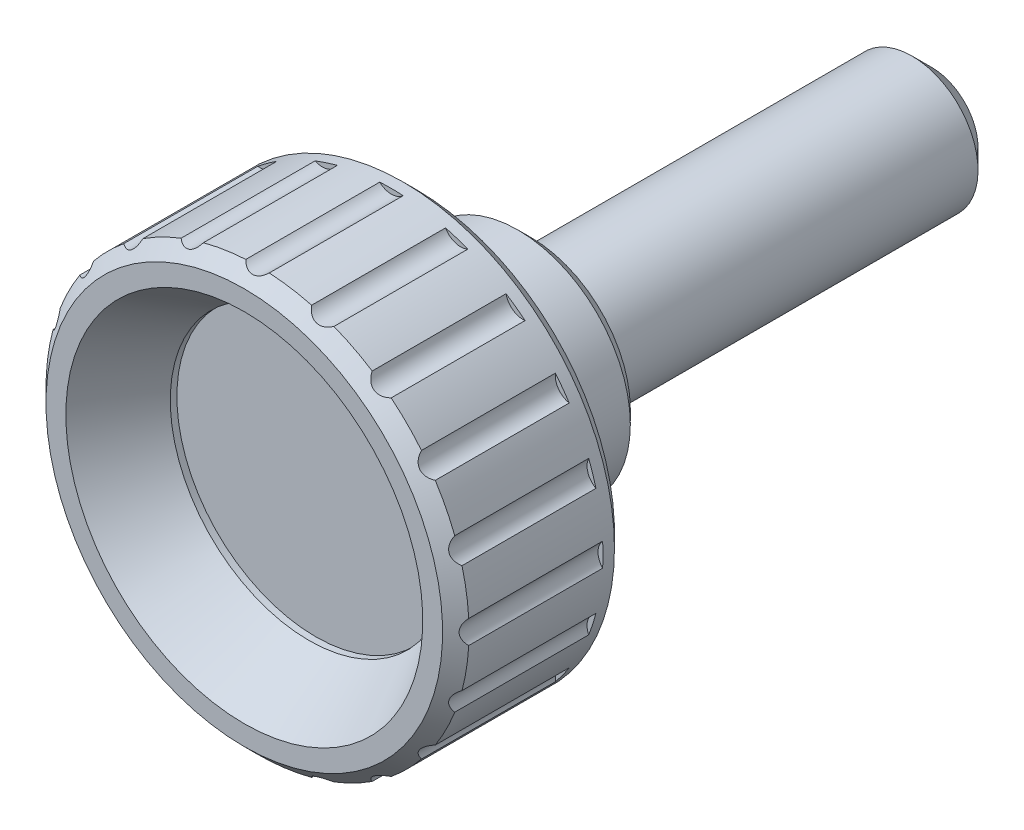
ISO-10303-21;
HEADER;
FILE_DESCRIPTION(('STEP AP214'),'2;1');
FILE_NAME('part.step','',(''),(''),'','','');
FILE_SCHEMA(('AUTOMOTIVE_DESIGN { 1 0 10303 214 1 1 1 1 }'));
ENDSEC;
DATA;
#1=APPLICATION_CONTEXT('core data for automotive mechanical design processes');
#2=APPLICATION_PROTOCOL_DEFINITION('international standard','automotive_design',2000,#1);
#3=PRODUCT_CONTEXT('',#1,'mechanical');
#4=PRODUCT('Part','Part','',(#3));
#5=PRODUCT_RELATED_PRODUCT_CATEGORY('part','',(#4));
#6=PRODUCT_DEFINITION_FORMATION('','',#4);
#7=PRODUCT_DEFINITION_CONTEXT('part definition',#1,'design');
#8=PRODUCT_DEFINITION('design','',#6,#7);
#9=PRODUCT_DEFINITION_SHAPE('','',#8);
#10=(LENGTH_UNIT() NAMED_UNIT(*) SI_UNIT(.MILLI.,.METRE.));
#11=(NAMED_UNIT(*) PLANE_ANGLE_UNIT() SI_UNIT($,.RADIAN.));
#12=(NAMED_UNIT(*) SI_UNIT($,.STERADIAN.) SOLID_ANGLE_UNIT());
#13=UNCERTAINTY_MEASURE_WITH_UNIT(LENGTH_MEASURE(1.E-05),#10,'distance_accuracy_value','');
#14=(GEOMETRIC_REPRESENTATION_CONTEXT(3) GLOBAL_UNCERTAINTY_ASSIGNED_CONTEXT((#13)) GLOBAL_UNIT_ASSIGNED_CONTEXT((#10,
#11,#12)) REPRESENTATION_CONTEXT('',''));
#15=CARTESIAN_POINT('',(0.,0.,0.));
#16=DIRECTION('',(0.,0.,1.));
#17=DIRECTION('',(1.,0.,0.));
#18=AXIS2_PLACEMENT_3D('',#15,#16,#17);
#19=CARTESIAN_POINT('',(7.5,1.06600726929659E-13,0.300000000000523));
#20=DIRECTION('',(0.,-3.55335756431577E-13,-1.));
#21=DIRECTION('',(0.,1.,-3.55335756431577E-13));
#22=AXIS2_PLACEMENT_3D('',#19,#20,#21);
#23=PLANE('',#22);
#24=CARTESIAN_POINT('',(0.,1.06600726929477E-13,0.300000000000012));
#25=DIRECTION('',(0.,-3.55335756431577E-13,-1.));
#26=DIRECTION('',(0.,1.,-3.55335756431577E-13));
#27=AXIS2_PLACEMENT_3D('',#24,#25,#26);
#28=CIRCLE('',#27,7.5);
#29=CARTESIAN_POINT('',(0.,7.50000000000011,0.299999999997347));
#30=VERTEX_POINT('',#29);
#31=EDGE_CURVE('E1107',#30,#30,#28,.T.);
#32=ORIENTED_EDGE('',*,*,#31,.T.);
#33=EDGE_LOOP('',(#32));
#34=FACE_BOUND('',#33,.T.);
#35=CARTESIAN_POINT('',(0.,1.06600726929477E-13,0.300000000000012));
#36=DIRECTION('',(0.,-3.55335756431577E-13,-1.));
#37=DIRECTION('',(0.,1.,-3.55335756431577E-13));
#38=AXIS2_PLACEMENT_3D('',#35,#36,#37);
#39=CIRCLE('',#38,6.);
#40=CARTESIAN_POINT('',(0.,6.00000000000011,0.29999999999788));
#41=VERTEX_POINT('',#40);
#42=EDGE_CURVE('E1321',#41,#41,#39,.T.);
#43=ORIENTED_EDGE('',*,*,#42,.F.);
#44=EDGE_LOOP('',(#43));
#45=FACE_BOUND('',#44,.T.);
#46=ADVANCED_FACE('F14',(#34,#45),#23,.T.);
#47=CARTESIAN_POINT('',(-1.43127530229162E-12,7.46205088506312E-12,21.));
#48=DIRECTION('',(0.,-3.55335756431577E-13,-1.));
#49=DIRECTION('',(0.,1.,-3.55335756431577E-13));
#50=AXIS2_PLACEMENT_3D('',#47,#48,#49);
#51=CONICAL_SURFACE('',#50,16.,0.785398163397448);
#52=CARTESIAN_POINT('',(-1.49943126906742E-12,7.81738664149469E-12,22.));
#53=DIRECTION('',(0.,-3.55335756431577E-13,-1.));
#54=DIRECTION('',(0.,1.,-3.55335756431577E-13));
#55=AXIS2_PLACEMENT_3D('',#52,#53,#54);
#56=CIRCLE('',#55,15.);
#57=CARTESIAN_POINT('',(-1.49943126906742E-12,15.0000000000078,21.9999999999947));
#58=VERTEX_POINT('',#57);
#59=EDGE_CURVE('E580',#58,#58,#56,.T.);
#60=ORIENTED_EDGE('',*,*,#59,.T.);
#61=EDGE_LOOP('',(#60));
#62=FACE_BOUND('',#61,.T.);
#63=CARTESIAN_POINT('',(-1.43127530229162E-12,7.46205088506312E-12,21.));
#64=DIRECTION('',(0.,-3.55335756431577E-13,-1.));
#65=DIRECTION('',(0.,1.,-3.55335756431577E-13));
#66=AXIS2_PLACEMENT_3D('',#63,#64,#65);
#67=CIRCLE('',#66,16.);
#68=CARTESIAN_POINT('',(15.9753508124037,-0.887787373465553,21.0000000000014));
#69=VERTEX_POINT('',#68);
#70=CARTESIAN_POINT('',(15.4678028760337,-4.09231892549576,21.0000000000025));
#71=VERTEX_POINT('',#70);
#72=EDGE_CURVE('E585',#69,#71,#67,.T.);
#73=ORIENTED_EDGE('',*,*,#72,.F.);
#74=CARTESIAN_POINT('',(15.9755398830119,-0.887989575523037,20.9998000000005));
#75=CARTESIAN_POINT('',(15.9351784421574,-0.844826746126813,21.0424866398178));
#76=CARTESIAN_POINT('',(15.8966188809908,-0.797693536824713,21.0834537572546));
#77=CARTESIAN_POINT('',(15.8245769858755,-0.695019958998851,21.1602482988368));
#78=CARTESIAN_POINT('',(15.791150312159,-0.639398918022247,21.1960191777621));
#79=CARTESIAN_POINT('',(15.7380490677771,-0.532816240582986,21.2530008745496));
#80=CARTESIAN_POINT('',(15.7169614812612,-0.48337112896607,21.275690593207));
#81=CARTESIAN_POINT('',(15.6806455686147,-0.380207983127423,21.3148283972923));
#82=CARTESIAN_POINT('',(15.6653967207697,-0.326505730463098,21.3312983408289));
#83=CARTESIAN_POINT('',(15.6416857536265,-0.215315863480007,21.3569309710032));
#84=CARTESIAN_POINT('',(15.6332906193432,-0.157796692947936,21.366021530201));
#85=CARTESIAN_POINT('',(15.6243518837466,-0.0414082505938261,21.3757012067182));
#86=CARTESIAN_POINT('',(15.623808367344,0.0174610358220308,21.3762902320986));
#87=CARTESIAN_POINT('',(15.6301546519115,0.12624587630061,21.3694172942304));
#88=CARTESIAN_POINT('',(15.6360489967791,0.176295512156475,21.3630334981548));
#89=CARTESIAN_POINT('',(15.6532896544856,0.274274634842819,21.344383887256));
#90=CARTESIAN_POINT('',(15.6646343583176,0.322204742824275,21.33211980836));
#91=CARTESIAN_POINT('',(15.6925197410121,0.416525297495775,21.3020256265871));
#92=CARTESIAN_POINT('',(15.709218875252,0.462813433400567,21.2840259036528));
#93=CARTESIAN_POINT('',(15.7468524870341,0.551635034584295,21.2435491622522));
#94=CARTESIAN_POINT('',(15.7677958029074,0.594160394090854,21.2210628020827));
#95=CARTESIAN_POINT('',(15.8173070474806,0.682678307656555,21.168037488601));
#96=CARTESIAN_POINT('',(15.846568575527,0.727842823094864,21.1367787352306));
#97=CARTESIAN_POINT('',(15.9086393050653,0.812237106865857,21.0706895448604));
#98=CARTESIAN_POINT('',(15.9414255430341,0.851501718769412,21.0358822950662));
#99=CARTESIAN_POINT('',(15.9755398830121,0.887989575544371,20.9998));
#100=B_SPLINE_CURVE_WITH_KNOTS('',3,(#74,#75,#76,#77,#78,#79,#80,#81,#82,#83,#84,#85,#86,#87,
#88,#89,#90,#91,#92,#93,#94,#95,#96,#97,#98,#99),.UNSPECIFIED.,.F.,.F.,(4,2,2,2,2,2,2,2,2,2,2,2,
4),(0.,0.219100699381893,0.440431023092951,0.61478688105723,0.7885241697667,0.96393981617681,
1.13935735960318,1.29104866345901,1.44269521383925,1.59932369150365,1.75628175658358,
1.94245598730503,2.12748340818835),.UNSPECIFIED.);
#101=CARTESIAN_POINT('',(15.9753508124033,0.887787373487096,21.0000000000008));
#102=VERTEX_POINT('',#101);
#103=EDGE_CURVE('E586',#69,#102,#100,.T.);
#104=ORIENTED_EDGE('',*,*,#103,.T.);
#105=CARTESIAN_POINT('',(15.467802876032,4.09231892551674,20.9999999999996));
#106=VERTEX_POINT('',#105);
#107=EDGE_CURVE('E589',#106,#102,#67,.T.);
#108=ORIENTED_EDGE('',*,*,#107,.F.);
#109=CARTESIAN_POINT('',(15.4680028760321,4.09220841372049,20.9998349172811));
#110=CARTESIAN_POINT('',(15.4162815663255,4.12078731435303,21.0425185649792));
#111=CARTESIAN_POINT('',(15.3650471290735,4.15369881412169,21.0834826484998));
#112=CARTESIAN_POINT('',(15.2648091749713,4.22908574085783,21.1602711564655));
#113=CARTESIAN_POINT('',(15.2158336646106,4.27165508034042,21.1960390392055));
#114=CARTESIAN_POINT('',(15.1323998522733,4.35661227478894,21.2530163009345));
#115=CARTESIAN_POINT('',(15.0970664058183,4.39712151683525,21.2757043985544));
#116=CARTESIAN_POINT('',(15.030651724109,4.48401408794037,21.3148389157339));
#117=CARTESIAN_POINT('',(14.9995558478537,4.530376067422,21.3313071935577));
#118=CARTESIAN_POINT('',(14.9426490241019,4.62879687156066,21.3569365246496));
#119=CARTESIAN_POINT('',(14.9168920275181,4.68090639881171,21.3660254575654));
#120=CARTESIAN_POINT('',(14.8724279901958,4.78883525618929,21.3757021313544));
#121=CARTESIAN_POINT('',(14.8537210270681,4.84465462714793,21.3762897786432));
#122=CARTESIAN_POINT('',(14.8261428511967,4.95007522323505,21.3694146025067));
#123=CARTESIAN_POINT('',(14.8162835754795,4.9994964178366,21.363029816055));
#124=CARTESIAN_POINT('',(14.8024051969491,5.09800697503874,21.3443784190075));
#125=CARTESIAN_POINT('',(14.7983843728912,5.14709643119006,21.3321135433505));
#126=CARTESIAN_POINT('',(14.7957600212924,5.2454174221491,21.302017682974));
#127=CARTESIAN_POINT('',(14.7973389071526,5.29460058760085,21.2840169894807));
#128=CARTESIAN_POINT('',(14.8056849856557,5.39070462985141,21.243538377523));
#129=CARTESIAN_POINT('',(14.8124630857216,5.43762052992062,21.2210511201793));
#130=CARTESIAN_POINT('',(14.8321965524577,5.53709129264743,21.1680316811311));
#131=CARTESIAN_POINT('',(14.8460657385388,5.58907402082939,21.1367810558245));
#132=CARTESIAN_POINT('',(14.8790094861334,5.6884938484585,21.0707098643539));
#133=CARTESIAN_POINT('',(14.8980514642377,5.73595697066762,21.0359124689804));
#134=CARTESIAN_POINT('',(14.9192136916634,5.78119085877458,20.9998404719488));
#135=B_SPLINE_CURVE_WITH_KNOTS('',3,(#109,#110,#111,#112,#113,#114,#115,#116,#117,#118,#119,
#120,#121,#122,#123,#124,#125,#126,#127,#128,#129,#130,#131,#132,#133,#134),.UNSPECIFIED.,.F.,
.F.,(4,2,2,2,2,2,2,2,2,2,2,2,4),(0.,0.219090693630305,0.440410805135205,0.614763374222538,
0.788497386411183,0.963909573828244,1.13932369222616,1.29101393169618,1.44265944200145,
1.59928961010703,1.75624927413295,1.94237523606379,2.12735493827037),.UNSPECIFIED.);
#136=CARTESIAN_POINT('',(14.9191201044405,5.78099085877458,20.9999999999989));
#137=VERTEX_POINT('',#136);
#138=EDGE_CURVE('E276',#106,#137,#135,.T.);
#139=ORIENTED_EDGE('',*,*,#138,.T.);
#140=CARTESIAN_POINT('',(13.4461586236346,8.67184053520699,20.9999999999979));
#141=VERTEX_POINT('',#140);
#142=EDGE_CURVE('E592',#141,#137,#67,.T.);
#143=ORIENTED_EDGE('',*,*,#142,.F.);
#144=CARTESIAN_POINT('',(13.4463586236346,8.6718019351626,20.9998528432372));
#145=CARTESIAN_POINT('',(13.3883385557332,8.68300023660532,21.0425349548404));
#146=CARTESIAN_POINT('',(13.329442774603,8.69846942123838,21.0834974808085));
#147=CARTESIAN_POINT('',(13.2108177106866,8.73919269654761,21.1602828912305));
#148=CARTESIAN_POINT('',(13.151086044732,8.76454475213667,21.1960492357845));
#149=CARTESIAN_POINT('',(13.045484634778,8.81956217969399,21.2530242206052));
#150=CARTESIAN_POINT('',(12.9993630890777,8.84717062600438,21.275711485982));
#151=CARTESIAN_POINT('',(12.9093490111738,8.90928797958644,21.3148443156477));
#152=CARTESIAN_POINT('',(12.865449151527,8.94377205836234,21.3313117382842));
#153=CARTESIAN_POINT('',(12.7809154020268,9.0197911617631,21.3569393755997));
#154=CARTESIAN_POINT('',(12.7403171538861,9.06139107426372,21.3660274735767));
#155=CARTESIAN_POINT('',(12.6646792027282,9.15029744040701,21.3757026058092));
#156=CARTESIAN_POINT('',(12.6296395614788,9.19760395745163,21.3762895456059));
#157=CARTESIAN_POINT('',(12.5708357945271,9.28934266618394,21.3694132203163));
#158=CARTESIAN_POINT('',(12.5461876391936,9.33329835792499,21.3630279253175));
#159=CARTESIAN_POINT('',(12.5025481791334,9.42269874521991,21.3443756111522));
#160=CARTESIAN_POINT('',(12.4835552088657,9.46814299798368,21.3321103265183));
#161=CARTESIAN_POINT('',(12.4506773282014,9.56084100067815,21.3020136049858));
#162=CARTESIAN_POINT('',(12.4369809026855,9.6081051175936,21.2840124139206));
#163=CARTESIAN_POINT('',(12.4152215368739,9.70208497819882,21.2435328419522));
#164=CARTESIAN_POINT('',(12.4071705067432,9.7487993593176,21.2210451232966));
#165=CARTESIAN_POINT('',(12.3952016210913,9.84949409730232,21.168027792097));
#166=CARTESIAN_POINT('',(12.3923288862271,9.9032128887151,21.1367802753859));
#167=CARTESIAN_POINT('',(12.3929374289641,10.0079364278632,21.0707160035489));
#168=CARTESIAN_POINT('',(12.3963796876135,10.0589558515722,21.0359224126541));
#169=CARTESIAN_POINT('',(12.4025267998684,10.1085106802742,20.9998544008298));
#170=B_SPLINE_CURVE_WITH_KNOTS('',3,(#144,#145,#146,#147,#148,#149,#150,#151,#152,#153,#154,
#155,#156,#157,#158,#159,#160,#161,#162,#163,#164,#165,#166,#167,#168,#169),.UNSPECIFIED.,.F.,
.F.,(4,2,2,2,2,2,2,2,2,2,2,2,4),(0.,0.21908555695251,0.440400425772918,0.61475130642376,
0.788483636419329,0.963894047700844,1.1393064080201,1.29099610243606,1.4426410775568,
1.59927210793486,1.75623259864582,1.94233964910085,2.12730065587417),.UNSPECIFIED.);
#171=CARTESIAN_POINT('',(12.4025019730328,10.1083106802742,20.9999999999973));
#172=VERTEX_POINT('',#171);
#173=EDGE_CURVE('E519',#141,#172,#170,.T.);
#174=ORIENTED_EDGE('',*,*,#173,.T.);
#175=CARTESIAN_POINT('',(10.1083106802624,12.4025019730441,20.9999999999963));
#176=VERTEX_POINT('',#175);
#177=EDGE_CURVE('E1289',#176,#172,#67,.T.);
#178=ORIENTED_EDGE('',*,*,#177,.F.);
#179=CARTESIAN_POINT('',(10.1085106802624,12.4025267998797,20.9998544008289));
#180=CARTESIAN_POINT('',(10.0498699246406,12.3952479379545,21.042536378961));
#181=CARTESIAN_POINT('',(9.9890765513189,12.3917603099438,21.0834987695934));
#182=CARTESIAN_POINT('',(9.86367341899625,12.3938334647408,21.1602839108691));
#183=CARTESIAN_POINT('',(9.79903112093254,12.3994866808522,21.1960501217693));
#184=CARTESIAN_POINT('',(9.68159704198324,12.4191788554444,21.2530249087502));
#185=CARTESIAN_POINT('',(9.62920140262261,12.4311837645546,21.2757121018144));
#186=CARTESIAN_POINT('',(9.52439769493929,12.4624451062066,21.3148447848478));
#187=CARTESIAN_POINT('',(9.47199033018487,12.4816756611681,21.3313121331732));
#188=CARTESIAN_POINT('',(9.36810287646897,12.527851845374,21.3569396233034));
#189=CARTESIAN_POINT('',(9.31663663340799,12.5548702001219,21.3660276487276));
#190=CARTESIAN_POINT('',(9.21722722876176,12.6160518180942,21.3757026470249));
#191=CARTESIAN_POINT('',(9.16928410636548,12.6502151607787,21.3762895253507));
#192=CARTESIAN_POINT('',(9.08500969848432,12.7192925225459,21.3694131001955));
#193=CARTESIAN_POINT('',(9.04798489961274,12.7534801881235,21.3630277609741));
#194=CARTESIAN_POINT('',(8.97885516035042,12.825019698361,21.3443753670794));
#195=CARTESIAN_POINT('',(8.94674877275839,12.8623706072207,21.3321100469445));
#196=CARTESIAN_POINT('',(8.8868348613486,12.9403718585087,21.3020132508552));
#197=CARTESIAN_POINT('',(8.85920339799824,12.9810903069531,21.2840120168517));
#198=CARTESIAN_POINT('',(8.80946769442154,13.0637465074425,21.243532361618));
#199=CARTESIAN_POINT('',(8.78737520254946,13.1056866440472,21.2210446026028));
#200=CARTESIAN_POINT('',(8.74487571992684,13.1977546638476,21.1680270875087));
#201=CARTESIAN_POINT('',(8.72554355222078,13.247956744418,21.1367794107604));
#202=CARTESIAN_POINT('',(8.69376097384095,13.3477431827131,21.0707148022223));
#203=CARTESIAN_POINT('',(8.68126891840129,13.3973294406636,21.0359210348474));
#204=CARTESIAN_POINT('',(8.67180193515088,13.4463586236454,20.9998528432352));
#205=B_SPLINE_CURVE_WITH_KNOTS('',3,(#179,#180,#181,#182,#183,#184,#185,#186,#187,#188,#189,
#190,#191,#192,#193,#194,#195,#196,#197,#198,#199,#200,#201,#202,#203,#204),.UNSPECIFIED.,.F.,
.F.,(4,2,2,2,2,2,2,2,2,2,2,2,4),(0.,0.219085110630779,0.440399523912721,0.614750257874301,
0.788482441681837,0.963892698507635,1.13930490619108,1.29099455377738,1.44263948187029,
1.599270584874,1.75623114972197,1.94233892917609,2.12730065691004),.UNSPECIFIED.);
#206=CARTESIAN_POINT('',(8.67184053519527,13.4461586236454,20.9999999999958));
#207=VERTEX_POINT('',#206);
#208=EDGE_CURVE('E1279',#176,#207,#205,.T.);
#209=ORIENTED_EDGE('',*,*,#208,.T.);
#210=CARTESIAN_POINT('',(5.78099085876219,14.9191201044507,20.9999999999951));
#211=VERTEX_POINT('',#210);
#212=EDGE_CURVE('E599',#211,#207,#67,.T.);
#213=ORIENTED_EDGE('',*,*,#212,.F.);
#214=CARTESIAN_POINT('',(5.78119085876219,14.9192136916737,20.9998404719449));
#215=CARTESIAN_POINT('',(5.72766915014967,14.8941689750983,21.0425236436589));
#216=CARTESIAN_POINT('',(5.67092851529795,14.872064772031,21.0834872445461));
#217=CARTESIAN_POINT('',(5.5510212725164,14.8352827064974,21.1602747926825));
#218=CARTESIAN_POINT('',(5.48779515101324,14.8206827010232,21.1960421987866));
#219=CARTESIAN_POINT('',(5.37002254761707,14.8031204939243,21.2530187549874));
#220=CARTESIAN_POINT('',(5.31648146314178,14.7983461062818,21.2757065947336));
#221=CARTESIAN_POINT('',(5.20714649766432,14.7956901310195,21.3148405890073));
#222=CARTESIAN_POINT('',(5.15136128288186,14.7977841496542,21.3313086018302));
#223=CARTESIAN_POINT('',(5.03828848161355,14.8095962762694,21.3569374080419));
#224=CARTESIAN_POINT('',(4.98099158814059,14.8193878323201,21.3660260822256));
#225=CARTESIAN_POINT('',(4.86754042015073,14.8468549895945,21.3757022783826));
#226=CARTESIAN_POINT('',(4.81138615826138,14.8645306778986,21.3762897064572));
#227=CARTESIAN_POINT('',(4.7098894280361,14.9041843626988,21.3694141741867));
#228=CARTESIAN_POINT('',(4.66411184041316,14.9252571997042,21.3630292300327));
#229=CARTESIAN_POINT('',(4.5762579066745,14.971932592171,21.344377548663));
#230=CARTESIAN_POINT('',(4.53418047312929,14.9975338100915,21.3321125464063));
#231=CARTESIAN_POINT('',(4.45309476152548,15.0532024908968,21.3020164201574));
#232=CARTESIAN_POINT('',(4.41423284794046,15.0833891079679,21.2840155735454));
#233=CARTESIAN_POINT('',(4.3413888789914,15.1466300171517,21.2435366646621));
#234=CARTESIAN_POINT('',(4.30741726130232,15.1796902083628,21.2210492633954));
#235=CARTESIAN_POINT('',(4.2385424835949,15.2541231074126,21.1680291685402));
#236=CARTESIAN_POINT('',(4.20463940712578,15.2958988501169,21.136777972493));
#237=CARTESIAN_POINT('',(4.1435705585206,15.3809897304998,21.0707055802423));
#238=CARTESIAN_POINT('',(4.11636458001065,15.4242938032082,21.0359075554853));
#239=CARTESIAN_POINT('',(4.09220841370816,15.4680028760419,20.9998349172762));
#240=B_SPLINE_CURVE_WITH_KNOTS('',3,(#214,#215,#216,#217,#218,#219,#220,#221,#222,#223,#224,
#225,#226,#227,#228,#229,#230,#231,#232,#233,#234,#235,#236,#237,#238,#239),.UNSPECIFIED.,.F.,
.F.,(4,2,2,2,2,2,2,2,2,2,2,2,4),(0.,0.21908910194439,0.440407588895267,0.614759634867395,
0.78849312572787,0.963904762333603,1.13931833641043,1.29100840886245,1.44265375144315,
1.59928417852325,1.7562441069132,1.9423726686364,2.12735494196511),.UNSPECIFIED.);
#241=CARTESIAN_POINT('',(4.09231892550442,15.4678028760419,20.9999999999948));
#242=VERTEX_POINT('',#241);
#243=EDGE_CURVE('E1271',#211,#242,#240,.T.);
#244=ORIENTED_EDGE('',*,*,#243,.T.);
#245=CARTESIAN_POINT('',(0.887787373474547,15.9753508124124,20.9999999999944));
#246=VERTEX_POINT('',#245);
#247=EDGE_CURVE('E595',#246,#242,#67,.T.);
#248=ORIENTED_EDGE('',*,*,#247,.F.);
#249=CARTESIAN_POINT('',(0.887987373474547,15.9755378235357,20.9998021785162));
#250=CARTESIAN_POINT('',(0.844824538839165,15.9351765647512,21.0424886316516));
#251=CARTESIAN_POINT('',(0.797691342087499,15.8966171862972,21.0834555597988));
#252=CARTESIAN_POINT('',(0.695017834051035,15.8245756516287,21.1602497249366));
#253=CARTESIAN_POINT('',(0.639396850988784,15.7911491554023,21.1960204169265));
#254=CARTESIAN_POINT('',(0.532814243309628,15.7380481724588,21.2530018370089));
#255=CARTESIAN_POINT('',(0.483369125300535,15.716960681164,21.2756914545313));
#256=CARTESIAN_POINT('',(0.380205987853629,15.6806449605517,21.3148290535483));
#257=CARTESIAN_POINT('',(0.326503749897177,15.665396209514,21.3312988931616));
#258=CARTESIAN_POINT('',(0.215313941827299,15.6416854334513,21.3569313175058));
#259=CARTESIAN_POINT('',(0.157794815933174,15.6332903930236,21.3660217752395));
#260=CARTESIAN_POINT('',(0.0414064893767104,15.6243518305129,21.3757012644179));
#261=CARTESIAN_POINT('',(-0.0174627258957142,15.6238083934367,21.3762902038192));
#262=CARTESIAN_POINT('',(-0.1262474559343,15.6301548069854,21.3694171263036));
#263=CARTESIAN_POINT('',(-0.176297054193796,15.6360492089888,21.3630332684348));
#264=CARTESIAN_POINT('',(-0.274276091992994,15.6532899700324,21.3443835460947));
#265=CARTESIAN_POINT('',(-0.322206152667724,15.664634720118,21.332119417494));
#266=CARTESIAN_POINT('',(-0.416526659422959,15.6925202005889,21.3020251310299));
#267=CARTESIAN_POINT('',(-0.462814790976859,15.7092193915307,21.2840253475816));
#268=CARTESIAN_POINT('',(-0.551636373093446,15.7468531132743,21.2435484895));
#269=CARTESIAN_POINT('',(-0.594161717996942,15.7677964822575,21.2210620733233));
#270=CARTESIAN_POINT('',(-0.682678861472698,15.8173074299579,21.1680370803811));
#271=CARTESIAN_POINT('',(-0.72784270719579,15.8465685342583,21.1367787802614));
#272=CARTESIAN_POINT('',(-0.812235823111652,15.9086383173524,21.0706905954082));
#273=CARTESIAN_POINT('',(-0.851499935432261,15.9414240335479,21.0358838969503));
#274=CARTESIAN_POINT('',(-0.887987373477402,15.9755378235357,20.999802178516));
#275=B_SPLINE_CURVE_WITH_KNOTS('',3,(#249,#250,#251,#252,#253,#254,#255,#256,#257,#258,#259,
#260,#261,#262,#263,#264,#265,#266,#267,#268,#269,#270,#271,#272,#273,#274),.UNSPECIFIED.,.F.,
.F.,(4,2,2,2,2,2,2,2,2,2,2,2,4),(0.,0.219100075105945,0.440429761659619,0.614785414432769,
0.788522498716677,0.963937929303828,1.13935525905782,1.29104649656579,1.44269298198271,
1.59932156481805,1.75627972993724,1.94245124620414,2.12747598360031),.UNSPECIFIED.);
#276=CARTESIAN_POINT('',(-0.887787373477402,15.9753508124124,20.9999999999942));
#277=VERTEX_POINT('',#276);
#278=EDGE_CURVE('E1264',#246,#277,#275,.T.);
#279=ORIENTED_EDGE('',*,*,#278,.T.);
#280=CARTESIAN_POINT('',(-4.09231892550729,15.4678028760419,20.9999999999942));
#281=VERTEX_POINT('',#280);
#282=EDGE_CURVE('E600',#281,#277,#67,.T.);
#283=ORIENTED_EDGE('',*,*,#282,.F.);
#284=CARTESIAN_POINT('',(-4.09220841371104,15.4680028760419,20.9998349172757));
#285=CARTESIAN_POINT('',(-4.12078731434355,15.4162815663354,21.0425185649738));
#286=CARTESIAN_POINT('',(-4.15369881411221,15.3650471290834,21.0834826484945));
#287=CARTESIAN_POINT('',(-4.22908574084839,15.2648091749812,21.1602711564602));
#288=CARTESIAN_POINT('',(-4.271655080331,15.2158336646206,21.1960390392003));
#289=CARTESIAN_POINT('',(-4.35661227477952,15.1323998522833,21.2530163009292));
#290=CARTESIAN_POINT('',(-4.39712151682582,15.0970664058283,21.2757043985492));
#291=CARTESIAN_POINT('',(-4.48401408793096,15.0306517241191,21.3148389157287));
#292=CARTESIAN_POINT('',(-4.53037606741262,14.9995558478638,21.3313071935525));
#293=CARTESIAN_POINT('',(-4.6287968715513,14.942649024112,21.3569365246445));
#294=CARTESIAN_POINT('',(-4.68090639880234,14.9168920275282,21.3660254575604));
#295=CARTESIAN_POINT('',(-4.78883525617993,14.872427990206,21.3757021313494));
#296=CARTESIAN_POINT('',(-4.84465462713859,14.8537210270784,21.3762897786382));
#297=CARTESIAN_POINT('',(-4.95007522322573,14.826142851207,21.3694146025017));
#298=CARTESIAN_POINT('',(-4.99949641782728,14.8162835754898,21.3630298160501));
#299=CARTESIAN_POINT('',(-5.09800697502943,14.8024051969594,21.3443784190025));
#300=CARTESIAN_POINT('',(-5.14709643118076,14.7983843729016,21.3321135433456));
#301=CARTESIAN_POINT('',(-5.24541742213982,14.7957600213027,21.3020176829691));
#302=CARTESIAN_POINT('',(-5.29460058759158,14.797338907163,21.2840169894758));
#303=CARTESIAN_POINT('',(-5.39070462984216,14.805684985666,21.2435383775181));
#304=CARTESIAN_POINT('',(-5.43762052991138,14.8124630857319,21.2210511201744));
#305=CARTESIAN_POINT('',(-5.53709129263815,14.832196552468,21.1680316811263));
#306=CARTESIAN_POINT('',(-5.58907402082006,14.8460657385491,21.1367810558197));
#307=CARTESIAN_POINT('',(-5.68849384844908,14.8790094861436,21.0707098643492));
#308=CARTESIAN_POINT('',(-5.73595697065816,14.8980514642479,21.0359124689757));
#309=CARTESIAN_POINT('',(-5.78119085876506,14.9192136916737,20.9998404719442));
#310=B_SPLINE_CURVE_WITH_KNOTS('',3,(#284,#285,#286,#287,#288,#289,#290,#291,#292,#293,#294,
#295,#296,#297,#298,#299,#300,#301,#302,#303,#304,#305,#306,#307,#308,#309),.UNSPECIFIED.,.F.,
.F.,(4,2,2,2,2,2,2,2,2,2,2,2,4),(0.,0.219090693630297,0.440410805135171,0.614763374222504,
0.788497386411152,0.96390957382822,1.13932369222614,1.29101393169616,1.44265944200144,
1.59928961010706,1.75624927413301,1.94237523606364,2.12735493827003),.UNSPECIFIED.);
#311=CARTESIAN_POINT('',(-5.78099085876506,14.9191201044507,20.9999999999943));
#312=VERTEX_POINT('',#311);
#313=EDGE_CURVE('E1257',#281,#312,#310,.T.);
#314=ORIENTED_EDGE('',*,*,#313,.T.);
#315=CARTESIAN_POINT('',(-8.67184053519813,13.4461586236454,20.9999999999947));
#316=VERTEX_POINT('',#315);
#317=EDGE_CURVE('E1126',#316,#312,#67,.T.);
#318=ORIENTED_EDGE('',*,*,#317,.F.);
#319=CARTESIAN_POINT('',(-8.67180193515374,13.4463586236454,20.999852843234));
#320=CARTESIAN_POINT('',(-8.68300023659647,13.3883385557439,21.0425349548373));
#321=CARTESIAN_POINT('',(-8.69846942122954,13.3294427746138,21.0834974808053));
#322=CARTESIAN_POINT('',(-8.73919269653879,13.2108177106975,21.1602828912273));
#323=CARTESIAN_POINT('',(-8.76454475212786,13.1510860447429,21.1960492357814));
#324=CARTESIAN_POINT('',(-8.81956217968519,13.0454846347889,21.253024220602));
#325=CARTESIAN_POINT('',(-8.84717062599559,12.9993630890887,21.2757114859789));
#326=CARTESIAN_POINT('',(-8.90928797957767,12.9093490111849,21.3148443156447));
#327=CARTESIAN_POINT('',(-8.94377205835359,12.8654491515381,21.3313117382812));
#328=CARTESIAN_POINT('',(-9.01979116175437,12.780915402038,21.3569393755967));
#329=CARTESIAN_POINT('',(-9.06139107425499,12.7403171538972,21.3660274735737));
#330=CARTESIAN_POINT('',(-9.1502974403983,12.6646792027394,21.3757026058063));
#331=CARTESIAN_POINT('',(-9.19760395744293,12.62963956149,21.376289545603));
#332=CARTESIAN_POINT('',(-9.28934266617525,12.5708357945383,21.3694132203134));
#333=CARTESIAN_POINT('',(-9.3332983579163,12.5461876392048,21.3630279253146));
#334=CARTESIAN_POINT('',(-9.42269874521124,12.5025481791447,21.3443756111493));
#335=CARTESIAN_POINT('',(-9.46814299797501,12.483555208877,21.3321103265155));
#336=CARTESIAN_POINT('',(-9.56084100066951,12.4506773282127,21.302013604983));
#337=CARTESIAN_POINT('',(-9.60810511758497,12.4369809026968,21.2840124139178));
#338=CARTESIAN_POINT('',(-9.70208497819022,12.4152215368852,21.2435328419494));
#339=CARTESIAN_POINT('',(-9.74879935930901,12.4071705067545,21.2210451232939));
#340=CARTESIAN_POINT('',(-9.84949409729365,12.3952016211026,21.1680277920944));
#341=CARTESIAN_POINT('',(-9.90321288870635,12.3923288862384,21.1367802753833));
#342=CARTESIAN_POINT('',(-10.0079364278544,12.3929374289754,21.0707160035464));
#343=CARTESIAN_POINT('',(-10.0589558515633,12.3963796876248,21.0359224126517));
#344=CARTESIAN_POINT('',(-10.1085106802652,12.4025267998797,20.9998544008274));
#345=B_SPLINE_CURVE_WITH_KNOTS('',3,(#319,#320,#321,#322,#323,#324,#325,#326,#327,#328,#329,
#330,#331,#332,#333,#334,#335,#336,#337,#338,#339,#340,#341,#342,#343,#344),.UNSPECIFIED.,.F.,
.F.,(4,2,2,2,2,2,2,2,2,2,2,2,4),(0.,0.21908555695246,0.440400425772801,0.614751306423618,
0.78848363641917,0.96389404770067,1.13930640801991,1.29099610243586,1.4426410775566,
1.59927210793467,1.75623259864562,1.94233964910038,2.12730065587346),.UNSPECIFIED.);
#346=CARTESIAN_POINT('',(-10.1083106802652,12.4025019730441,20.9999999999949));
#347=VERTEX_POINT('',#346);
#348=EDGE_CURVE('E1250',#316,#347,#345,.T.);
#349=ORIENTED_EDGE('',*,*,#348,.T.);
#350=CARTESIAN_POINT('',(-12.402501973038,10.1083106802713,20.9999999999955));
#351=VERTEX_POINT('',#350);
#352=EDGE_CURVE('E1129',#351,#347,#67,.T.);
#353=ORIENTED_EDGE('',*,*,#352,.F.);
#354=CARTESIAN_POINT('',(-12.4025267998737,10.1085106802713,20.9998544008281));
#355=CARTESIAN_POINT('',(-12.3952479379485,10.0498699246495,21.0425363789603));
#356=CARTESIAN_POINT('',(-12.3917603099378,9.98907655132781,21.0834987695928));
#357=CARTESIAN_POINT('',(-12.3938334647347,9.86367341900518,21.1602839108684));
#358=CARTESIAN_POINT('',(-12.3994866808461,9.79903112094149,21.1960501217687));
#359=CARTESIAN_POINT('',(-12.4191788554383,9.6815970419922,21.2530249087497));
#360=CARTESIAN_POINT('',(-12.4311837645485,9.62920140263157,21.2757121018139));
#361=CARTESIAN_POINT('',(-12.4624451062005,9.52439769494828,21.3148447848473));
#362=CARTESIAN_POINT('',(-12.481675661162,9.47199033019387,21.3313121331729));
#363=CARTESIAN_POINT('',(-12.5278518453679,9.36810287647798,21.356939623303));
#364=CARTESIAN_POINT('',(-12.5548702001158,9.316636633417,21.3660276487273));
#365=CARTESIAN_POINT('',(-12.6160518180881,9.21722722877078,21.3757026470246));
#366=CARTESIAN_POINT('',(-12.6502151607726,9.1692841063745,21.3762895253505));
#367=CARTESIAN_POINT('',(-12.7192925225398,9.08500969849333,21.3694131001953));
#368=CARTESIAN_POINT('',(-12.7534801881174,9.04798489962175,21.363027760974));
#369=CARTESIAN_POINT('',(-12.8250196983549,8.97885516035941,21.3443753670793));
#370=CARTESIAN_POINT('',(-12.8623706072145,8.94674877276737,21.3321100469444));
#371=CARTESIAN_POINT('',(-12.9403718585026,8.88683486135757,21.3020132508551));
#372=CARTESIAN_POINT('',(-12.9810903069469,8.8592033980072,21.2840120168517));
#373=CARTESIAN_POINT('',(-13.0637465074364,8.8094676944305,21.243532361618));
#374=CARTESIAN_POINT('',(-13.1056866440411,8.78737520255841,21.2210446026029));
#375=CARTESIAN_POINT('',(-13.1977546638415,8.74487571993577,21.1680270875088));
#376=CARTESIAN_POINT('',(-13.247956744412,8.72554355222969,21.1367794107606));
#377=CARTESIAN_POINT('',(-13.347743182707,8.69376097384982,21.0707148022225));
#378=CARTESIAN_POINT('',(-13.3973294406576,8.68126891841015,21.0359210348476));
#379=CARTESIAN_POINT('',(-13.4463586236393,8.67180193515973,20.9998528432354));
#380=B_SPLINE_CURVE_WITH_KNOTS('',3,(#354,#355,#356,#357,#358,#359,#360,#361,#362,#363,#364,
#365,#366,#367,#368,#369,#370,#371,#372,#373,#374,#375,#376,#377,#378,#379),.UNSPECIFIED.,.F.,
.F.,(4,2,2,2,2,2,2,2,2,2,2,2,4),(0.,0.219085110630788,0.440399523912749,0.614750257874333,
0.788482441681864,0.963892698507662,1.13930490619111,1.29099455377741,1.44263948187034,
1.59927058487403,1.75623114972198,1.94233892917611,2.12730065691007),.UNSPECIFIED.);
#381=CARTESIAN_POINT('',(-13.4461586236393,8.67184053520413,20.999999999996));
#382=VERTEX_POINT('',#381);
#383=EDGE_CURVE('E1240',#351,#382,#380,.T.);
#384=ORIENTED_EDGE('',*,*,#383,.T.);
#385=CARTESIAN_POINT('',(-14.9191201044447,5.78099085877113,20.999999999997));
#386=VERTEX_POINT('',#385);
#387=EDGE_CURVE('E1132',#386,#382,#67,.T.);
#388=ORIENTED_EDGE('',*,*,#387,.F.);
#389=CARTESIAN_POINT('',(-14.9192136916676,5.78119085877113,20.9998404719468));
#390=CARTESIAN_POINT('',(-14.8941689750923,5.7276691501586,21.0425236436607));
#391=CARTESIAN_POINT('',(-14.8720647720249,5.6709285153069,21.0834872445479));
#392=CARTESIAN_POINT('',(-14.8352827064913,5.5510212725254,21.1602747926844));
#393=CARTESIAN_POINT('',(-14.8206827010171,5.48779515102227,21.1960421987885));
#394=CARTESIAN_POINT('',(-14.8031204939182,5.37002254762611,21.2530187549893));
#395=CARTESIAN_POINT('',(-14.7983461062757,5.31648146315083,21.2757065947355));
#396=CARTESIAN_POINT('',(-14.7956901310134,5.20714649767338,21.3148405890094));
#397=CARTESIAN_POINT('',(-14.797784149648,5.15136128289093,21.3313086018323));
#398=CARTESIAN_POINT('',(-14.8095962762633,5.03828848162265,21.356937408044));
#399=CARTESIAN_POINT('',(-14.819387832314,4.9809915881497,21.3660260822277));
#400=CARTESIAN_POINT('',(-14.8468549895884,4.86754042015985,21.3757022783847));
#401=CARTESIAN_POINT('',(-14.8645306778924,4.81138615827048,21.3762897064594));
#402=CARTESIAN_POINT('',(-14.9041843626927,4.70988942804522,21.369414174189));
#403=CARTESIAN_POINT('',(-14.9252571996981,4.66411184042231,21.363029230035));
#404=CARTESIAN_POINT('',(-14.9719325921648,4.57625790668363,21.3443775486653));
#405=CARTESIAN_POINT('',(-14.9975338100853,4.53418047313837,21.3321125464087));
#406=CARTESIAN_POINT('',(-15.0532024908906,4.45309476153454,21.3020164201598));
#407=CARTESIAN_POINT('',(-15.0833891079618,4.41423284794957,21.2840155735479));
#408=CARTESIAN_POINT('',(-15.1466300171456,4.3413888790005,21.2435366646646));
#409=CARTESIAN_POINT('',(-15.1796902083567,4.30741726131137,21.2210492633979));
#410=CARTESIAN_POINT('',(-15.2541231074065,4.2385424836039,21.1680291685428));
#411=CARTESIAN_POINT('',(-15.2958988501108,4.20463940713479,21.1367779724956));
#412=CARTESIAN_POINT('',(-15.3809897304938,4.14357055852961,21.0707055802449));
#413=CARTESIAN_POINT('',(-15.4242938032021,4.11636458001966,21.0359075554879));
#414=CARTESIAN_POINT('',(-15.4680028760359,4.0922084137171,20.9998349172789));
#415=B_SPLINE_CURVE_WITH_KNOTS('',3,(#389,#390,#391,#392,#393,#394,#395,#396,#397,#398,#399,
#400,#401,#402,#403,#404,#405,#406,#407,#408,#409,#410,#411,#412,#413,#414),.UNSPECIFIED.,.F.,
.F.,(4,2,2,2,2,2,2,2,2,2,2,2,4),(0.,0.219089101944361,0.440407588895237,0.614759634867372,
0.788493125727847,0.963904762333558,1.13931833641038,1.29100840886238,1.44265375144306,
1.59928417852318,1.75624410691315,1.94237266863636,2.12735494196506),.UNSPECIFIED.);
#416=CARTESIAN_POINT('',(-15.4678028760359,4.09231892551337,20.9999999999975));
#417=VERTEX_POINT('',#416);
#418=EDGE_CURVE('E1233',#386,#417,#415,.T.);
#419=ORIENTED_EDGE('',*,*,#418,.T.);
#420=CARTESIAN_POINT('',(-15.9753508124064,0.887787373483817,20.9999999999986));
#421=VERTEX_POINT('',#420);
#422=EDGE_CURVE('E1135',#421,#417,#67,.T.);
#423=ORIENTED_EDGE('',*,*,#422,.F.);
#424=CARTESIAN_POINT('',(-15.9755398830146,0.887989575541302,20.9997999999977));
#425=CARTESIAN_POINT('',(-15.9351784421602,0.84482674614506,21.042486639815));
#426=CARTESIAN_POINT('',(-15.8966188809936,0.797693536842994,21.0834537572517));
#427=CARTESIAN_POINT('',(-15.8245769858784,0.695019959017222,21.160248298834));
#428=CARTESIAN_POINT('',(-15.791150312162,0.639398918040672,21.1960191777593));
#429=CARTESIAN_POINT('',(-15.7380490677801,0.53281624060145,21.2530008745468));
#430=CARTESIAN_POINT('',(-15.7169614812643,0.483371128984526,21.2756905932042));
#431=CARTESIAN_POINT('',(-15.6806455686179,0.380207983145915,21.3148283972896));
#432=CARTESIAN_POINT('',(-15.6653967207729,0.326505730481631,21.3312983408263));
#433=CARTESIAN_POINT('',(-15.6416857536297,0.215315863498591,21.3569309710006));
#434=CARTESIAN_POINT('',(-15.6332906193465,0.157796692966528,21.3660215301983));
#435=CARTESIAN_POINT('',(-15.62435188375,0.0414082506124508,21.3757012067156));
#436=CARTESIAN_POINT('',(-15.6238083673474,-0.0174610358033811,21.376290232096));
#437=CARTESIAN_POINT('',(-15.6301546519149,-0.126245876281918,21.3694172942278));
#438=CARTESIAN_POINT('',(-15.6360489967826,-0.176295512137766,21.3630334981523));
#439=CARTESIAN_POINT('',(-15.6532896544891,-0.274274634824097,21.3443838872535));
#440=CARTESIAN_POINT('',(-15.6646343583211,-0.322204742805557,21.3321198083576));
#441=CARTESIAN_POINT('',(-15.6925197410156,-0.416525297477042,21.3020256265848));
#442=CARTESIAN_POINT('',(-15.7092188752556,-0.462813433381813,21.2840259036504));
#443=CARTESIAN_POINT('',(-15.7468524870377,-0.551635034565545,21.2435491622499));
#444=CARTESIAN_POINT('',(-15.767795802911,-0.594160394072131,21.2210628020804));
#445=CARTESIAN_POINT('',(-15.8173070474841,-0.682678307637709,21.1680374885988));
#446=CARTESIAN_POINT('',(-15.8465685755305,-0.727842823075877,21.1367787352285));
#447=CARTESIAN_POINT('',(-15.9086393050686,-0.812237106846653,21.0706895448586));
#448=CARTESIAN_POINT('',(-15.9414255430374,-0.851501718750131,21.0358822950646));
#449=CARTESIAN_POINT('',(-15.9755398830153,-0.887989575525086,20.9997999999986));
#450=B_SPLINE_CURVE_WITH_KNOTS('',3,(#424,#425,#426,#427,#428,#429,#430,#431,#432,#433,#434,
#435,#436,#437,#438,#439,#440,#441,#442,#443,#444,#445,#446,#447,#448,#449),.UNSPECIFIED.,.F.,
.F.,(4,2,2,2,2,2,2,2,2,2,2,2,4),(0.,0.219100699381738,0.440431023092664,0.614786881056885,
0.788524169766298,0.963939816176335,1.13935735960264,1.29104866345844,1.44269521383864,
1.59932369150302,1.75628175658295,1.94245598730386,2.12748340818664),.UNSPECIFIED.);
#451=CARTESIAN_POINT('',(-15.9753508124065,-0.887787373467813,20.9999999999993));
#452=VERTEX_POINT('',#451);
#453=EDGE_CURVE('E1226',#421,#452,#450,.T.);
#454=ORIENTED_EDGE('',*,*,#453,.T.);
#455=CARTESIAN_POINT('',(-15.467802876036,-4.09231892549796,21.0000000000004));
#456=VERTEX_POINT('',#455);
#457=EDGE_CURVE('E1138',#456,#452,#67,.T.);
#458=ORIENTED_EDGE('',*,*,#457,.F.);
#459=CARTESIAN_POINT('',(-15.468002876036,-4.09220841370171,20.9998349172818));
#460=CARTESIAN_POINT('',(-15.4162815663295,-4.12078731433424,21.04251856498));
#461=CARTESIAN_POINT('',(-15.3650471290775,-4.15369881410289,21.0834826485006));
#462=CARTESIAN_POINT('',(-15.2648091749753,-4.229085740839,21.1602711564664));
#463=CARTESIAN_POINT('',(-15.2158336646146,-4.27165508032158,21.1960390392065));
#464=CARTESIAN_POINT('',(-15.1323998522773,-4.35661227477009,21.2530163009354));
#465=CARTESIAN_POINT('',(-15.0970664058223,-4.39712151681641,21.2757043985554));
#466=CARTESIAN_POINT('',(-15.0306517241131,-4.48401408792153,21.314838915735));
#467=CARTESIAN_POINT('',(-14.9995558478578,-4.53037606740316,21.3313071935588));
#468=CARTESIAN_POINT('',(-14.942649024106,-4.62879687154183,21.3569365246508));
#469=CARTESIAN_POINT('',(-14.9168920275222,-4.68090639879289,21.3660254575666));
#470=CARTESIAN_POINT('',(-14.8724279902,-4.78883525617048,21.3757021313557));
#471=CARTESIAN_POINT('',(-14.8537210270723,-4.84465462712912,21.3762897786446));
#472=CARTESIAN_POINT('',(-14.8261428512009,-4.95007522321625,21.3694146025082));
#473=CARTESIAN_POINT('',(-14.8162835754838,-4.99949641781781,21.3630298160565));
#474=CARTESIAN_POINT('',(-14.8024051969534,-5.09800697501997,21.344378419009));
#475=CARTESIAN_POINT('',(-14.7983843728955,-5.14709643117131,21.332113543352));
#476=CARTESIAN_POINT('',(-14.7957600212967,-5.24541742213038,21.3020176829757));
#477=CARTESIAN_POINT('',(-14.797338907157,-5.29460058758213,21.2840169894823));
#478=CARTESIAN_POINT('',(-14.80568498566,-5.39070462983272,21.2435383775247));
#479=CARTESIAN_POINT('',(-14.8124630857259,-5.43762052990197,21.221051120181));
#480=CARTESIAN_POINT('',(-14.832196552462,-5.53709129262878,21.168031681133));
#481=CARTESIAN_POINT('',(-14.8460657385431,-5.5890740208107,21.1367810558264));
#482=CARTESIAN_POINT('',(-14.8790094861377,-5.68849384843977,21.0707098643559));
#483=CARTESIAN_POINT('',(-14.8980514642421,-5.73595697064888,21.0359124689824));
#484=CARTESIAN_POINT('',(-14.9192136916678,-5.78119085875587,20.9998404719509));
#485=B_SPLINE_CURVE_WITH_KNOTS('',3,(#459,#460,#461,#462,#463,#464,#465,#466,#467,#468,#469,
#470,#471,#472,#473,#474,#475,#476,#477,#478,#479,#480,#481,#482,#483,#484),.UNSPECIFIED.,.F.,
.F.,(4,2,2,2,2,2,2,2,2,2,2,2,4),(0.,0.219090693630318,0.440410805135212,0.614763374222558,
0.788497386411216,0.96390957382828,1.1393236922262,1.29101393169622,1.4426594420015,
1.5992896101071,1.75624927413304,1.94237523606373,2.12735493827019),.UNSPECIFIED.);
#486=CARTESIAN_POINT('',(-14.9191201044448,-5.78099085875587,21.0000000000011));
#487=VERTEX_POINT('',#486);
#488=EDGE_CURVE('E1219',#456,#487,#485,.T.);
#489=ORIENTED_EDGE('',*,*,#488,.T.);
#490=CARTESIAN_POINT('',(-13.4461586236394,-8.6718405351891,21.0000000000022));
#491=VERTEX_POINT('',#490);
#492=EDGE_CURVE('E1141',#491,#487,#67,.T.);
#493=ORIENTED_EDGE('',*,*,#492,.F.);
#494=CARTESIAN_POINT('',(-13.4463586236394,-8.67180193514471,20.9998528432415));
#495=CARTESIAN_POINT('',(-13.3883385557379,-8.68300023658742,21.0425349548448));
#496=CARTESIAN_POINT('',(-13.3294427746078,-8.69846942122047,21.0834974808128));
#497=CARTESIAN_POINT('',(-13.2108177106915,-8.73919269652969,21.1602828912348));
#498=CARTESIAN_POINT('',(-13.1510860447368,-8.76454475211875,21.1960492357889));
#499=CARTESIAN_POINT('',(-13.0454846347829,-8.81956217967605,21.2530242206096));
#500=CARTESIAN_POINT('',(-12.9993630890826,-8.84717062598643,21.2757114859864));
#501=CARTESIAN_POINT('',(-12.9093490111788,-8.9092879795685,21.3148443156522));
#502=CARTESIAN_POINT('',(-12.865449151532,-8.9437720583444,21.3313117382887));
#503=CARTESIAN_POINT('',(-12.7809154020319,-9.01979116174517,21.3569393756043));
#504=CARTESIAN_POINT('',(-12.7403171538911,-9.06139107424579,21.3660274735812));
#505=CARTESIAN_POINT('',(-12.6646792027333,-9.15029744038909,21.3757026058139));
#506=CARTESIAN_POINT('',(-12.6296395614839,-9.19760395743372,21.3762895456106));
#507=CARTESIAN_POINT('',(-12.5708357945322,-9.28934266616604,21.369413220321));
#508=CARTESIAN_POINT('',(-12.5461876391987,-9.3332983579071,21.3630279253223));
#509=CARTESIAN_POINT('',(-12.5025481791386,-9.42269874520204,21.344375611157));
#510=CARTESIAN_POINT('',(-12.4835552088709,-9.46814299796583,21.3321103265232));
#511=CARTESIAN_POINT('',(-12.4506773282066,-9.56084100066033,21.3020136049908));
#512=CARTESIAN_POINT('',(-12.4369809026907,-9.60810511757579,21.2840124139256));
#513=CARTESIAN_POINT('',(-12.4152215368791,-9.70208497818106,21.2435328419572));
#514=CARTESIAN_POINT('',(-12.4071705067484,-9.74879935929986,21.2210451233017));
#515=CARTESIAN_POINT('',(-12.3952016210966,-9.84949409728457,21.1680277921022));
#516=CARTESIAN_POINT('',(-12.3923288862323,-9.9032128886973,21.1367802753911));
#517=CARTESIAN_POINT('',(-12.3929374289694,-10.0079364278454,21.0707160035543));
#518=CARTESIAN_POINT('',(-12.3963796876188,-10.0589558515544,21.0359224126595));
#519=CARTESIAN_POINT('',(-12.4025267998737,-10.1085106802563,20.9998544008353));
#520=B_SPLINE_CURVE_WITH_KNOTS('',3,(#494,#495,#496,#497,#498,#499,#500,#501,#502,#503,#504,
#505,#506,#507,#508,#509,#510,#511,#512,#513,#514,#515,#516,#517,#518,#519),.UNSPECIFIED.,.F.,
.F.,(4,2,2,2,2,2,2,2,2,2,2,2,4),(0.,0.219085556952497,0.440400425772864,0.614751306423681,
0.788483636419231,0.963894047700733,1.13930640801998,1.29099610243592,1.44264107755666,
1.59927210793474,1.7562325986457,1.94233964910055,2.12730065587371),.UNSPECIFIED.);
#521=CARTESIAN_POINT('',(-12.402501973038,-10.1083106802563,21.0000000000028));
#522=VERTEX_POINT('',#521);
#523=EDGE_CURVE('E1209',#491,#522,#520,.T.);
#524=ORIENTED_EDGE('',*,*,#523,.T.);
#525=CARTESIAN_POINT('',(-10.108310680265,-12.4025019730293,21.0000000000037));
#526=VERTEX_POINT('',#525);
#527=EDGE_CURVE('E1144',#526,#522,#67,.T.);
#528=ORIENTED_EDGE('',*,*,#527,.F.);
#529=CARTESIAN_POINT('',(-10.108510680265,-12.4025267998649,20.9998544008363));
#530=CARTESIAN_POINT('',(-10.0498699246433,-12.3952479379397,21.0425363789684));
#531=CARTESIAN_POINT('',(-9.98907655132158,-12.391760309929,21.0834987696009));
#532=CARTESIAN_POINT('',(-9.86367341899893,-12.3938334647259,21.1602839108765));
#533=CARTESIAN_POINT('',(-9.79903112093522,-12.3994866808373,21.1960501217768));
#534=CARTESIAN_POINT('',(-9.68159704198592,-12.4191788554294,21.2530249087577));
#535=CARTESIAN_POINT('',(-9.62920140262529,-12.4311837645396,21.2757121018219));
#536=CARTESIAN_POINT('',(-9.52439769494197,-12.4624451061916,21.3148447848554));
#537=CARTESIAN_POINT('',(-9.47199033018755,-12.481675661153,21.3313121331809));
#538=CARTESIAN_POINT('',(-9.36810287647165,-12.5278518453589,21.3569396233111));
#539=CARTESIAN_POINT('',(-9.31663663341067,-12.5548702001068,21.3660276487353));
#540=CARTESIAN_POINT('',(-9.21722722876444,-12.6160518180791,21.3757026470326));
#541=CARTESIAN_POINT('',(-9.16928410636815,-12.6502151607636,21.3762895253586));
#542=CARTESIAN_POINT('',(-9.08500969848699,-12.7192925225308,21.3694131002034));
#543=CARTESIAN_POINT('',(-9.04798489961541,-12.7534801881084,21.363027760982));
#544=CARTESIAN_POINT('',(-8.97885516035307,-12.8250196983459,21.3443753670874));
#545=CARTESIAN_POINT('',(-8.94674877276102,-12.8623706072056,21.3321100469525));
#546=CARTESIAN_POINT('',(-8.88683486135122,-12.9403718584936,21.3020132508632));
#547=CARTESIAN_POINT('',(-8.85920339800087,-12.981090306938,21.2840120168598));
#548=CARTESIAN_POINT('',(-8.80946769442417,-13.0637465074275,21.2435323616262));
#549=CARTESIAN_POINT('',(-8.78737520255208,-13.1056866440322,21.2210446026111));
#550=CARTESIAN_POINT('',(-8.74487571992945,-13.1977546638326,21.1680270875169));
#551=CARTESIAN_POINT('',(-8.72554355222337,-13.2479567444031,21.1367794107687));
#552=CARTESIAN_POINT('',(-8.6937609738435,-13.3477431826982,21.0707148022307));
#553=CARTESIAN_POINT('',(-8.68126891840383,-13.3973294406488,21.0359210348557));
#554=CARTESIAN_POINT('',(-8.67180193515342,-13.4463586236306,20.9998528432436));
#555=B_SPLINE_CURVE_WITH_KNOTS('',3,(#529,#530,#531,#532,#533,#534,#535,#536,#537,#538,#539,
#540,#541,#542,#543,#544,#545,#546,#547,#548,#549,#550,#551,#552,#553,#554),.UNSPECIFIED.,.F.,
.F.,(4,2,2,2,2,2,2,2,2,2,2,2,4),(0.,0.219085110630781,0.440399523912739,0.614750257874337,
0.788482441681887,0.963892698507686,1.13930490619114,1.29099455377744,1.44263948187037,
1.59927058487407,1.75623114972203,1.94233892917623,2.12730065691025),.UNSPECIFIED.);
#556=CARTESIAN_POINT('',(-8.67184053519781,-13.4461586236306,21.0000000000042));
#557=VERTEX_POINT('',#556);
#558=EDGE_CURVE('E1202',#526,#557,#555,.T.);
#559=ORIENTED_EDGE('',*,*,#558,.T.);
#560=CARTESIAN_POINT('',(-5.78099085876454,-14.919120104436,21.0000000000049));
#561=VERTEX_POINT('',#560);
#562=EDGE_CURVE('E1147',#561,#557,#67,.T.);
#563=ORIENTED_EDGE('',*,*,#562,.F.);
#564=CARTESIAN_POINT('',(-5.78119085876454,-14.919213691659,20.9998404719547));
#565=CARTESIAN_POINT('',(-5.72766915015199,-14.8941689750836,21.0425236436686));
#566=CARTESIAN_POINT('',(-5.67092851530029,-14.8720647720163,21.0834872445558));
#567=CARTESIAN_POINT('',(-5.55102127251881,-14.8352827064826,21.1602747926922));
#568=CARTESIAN_POINT('',(-5.48779515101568,-14.8206827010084,21.1960421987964));
#569=CARTESIAN_POINT('',(-5.37002254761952,-14.8031204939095,21.2530187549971));
#570=CARTESIAN_POINT('',(-5.31648146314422,-14.798346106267,21.2757065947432));
#571=CARTESIAN_POINT('',(-5.20714649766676,-14.7956901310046,21.314840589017));
#572=CARTESIAN_POINT('',(-5.15136128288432,-14.7977841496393,21.33130860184));
#573=CARTESIAN_POINT('',(-5.03828848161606,-14.8095962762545,21.3569374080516));
#574=CARTESIAN_POINT('',(-4.98099158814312,-14.8193878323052,21.3660260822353));
#575=CARTESIAN_POINT('',(-4.86754042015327,-14.8468549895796,21.3757022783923));
#576=CARTESIAN_POINT('',(-4.8113861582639,-14.8645306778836,21.3762897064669));
#577=CARTESIAN_POINT('',(-4.70988942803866,-14.9041843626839,21.3694141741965));
#578=CARTESIAN_POINT('',(-4.66411184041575,-14.9252571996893,21.3630292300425));
#579=CARTESIAN_POINT('',(-4.57625790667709,-14.9719325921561,21.3443775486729));
#580=CARTESIAN_POINT('',(-4.53418047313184,-14.9975338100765,21.3321125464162));
#581=CARTESIAN_POINT('',(-4.45309476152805,-15.0532024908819,21.3020164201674));
#582=CARTESIAN_POINT('',(-4.41423284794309,-15.083389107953,21.2840155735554));
#583=CARTESIAN_POINT('',(-4.34138887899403,-15.1466300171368,21.2435366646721));
#584=CARTESIAN_POINT('',(-4.30741726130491,-15.1796902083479,21.2210492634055));
#585=CARTESIAN_POINT('',(-4.23854248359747,-15.2541231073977,21.1680291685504));
#586=CARTESIAN_POINT('',(-4.2046394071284,-15.295898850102,21.1367779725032));
#587=CARTESIAN_POINT('',(-4.14357055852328,-15.380989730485,21.0707055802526));
#588=CARTESIAN_POINT('',(-4.11636458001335,-15.4242938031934,21.0359075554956));
#589=CARTESIAN_POINT('',(-4.09220841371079,-15.4680028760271,20.9998349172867));
#590=B_SPLINE_CURVE_WITH_KNOTS('',3,(#564,#565,#566,#567,#568,#569,#570,#571,#572,#573,#574,
#575,#576,#577,#578,#579,#580,#581,#582,#583,#584,#585,#586,#587,#588,#589),.UNSPECIFIED.,.F.,
.F.,(4,2,2,2,2,2,2,2,2,2,2,2,4),(0.,0.219089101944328,0.440407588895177,0.614759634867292,
0.788493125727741,0.963904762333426,1.13931833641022,1.29100840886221,1.44265375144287,
1.59928417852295,1.75624410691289,1.94237266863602,2.12735494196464),.UNSPECIFIED.);
#591=CARTESIAN_POINT('',(-4.09231892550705,-15.4678028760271,21.0000000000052));
#592=VERTEX_POINT('',#591);
#593=EDGE_CURVE('E1195',#561,#592,#590,.T.);
#594=ORIENTED_EDGE('',*,*,#593,.T.);
#595=CARTESIAN_POINT('',(-0.887787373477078,-15.9753508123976,21.0000000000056));
#596=VERTEX_POINT('',#595);
#597=EDGE_CURVE('E1150',#596,#592,#67,.T.);
#598=ORIENTED_EDGE('',*,*,#597,.F.);
#599=CARTESIAN_POINT('',(-0.88798737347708,-15.9755378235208,20.9998021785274));
#600=CARTESIAN_POINT('',(-0.844824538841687,-15.9351765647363,21.0424886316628));
#601=CARTESIAN_POINT('',(-0.797691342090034,-15.8966171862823,21.0834555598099));
#602=CARTESIAN_POINT('',(-0.695017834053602,-15.8245756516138,21.1602497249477));
#603=CARTESIAN_POINT('',(-0.63939685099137,-15.7911491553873,21.1960204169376));
#604=CARTESIAN_POINT('',(-0.532814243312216,-15.7380481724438,21.2530018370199));
#605=CARTESIAN_POINT('',(-0.483369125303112,-15.716960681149,21.2756914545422));
#606=CARTESIAN_POINT('',(-0.380205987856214,-15.6806449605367,21.3148290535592));
#607=CARTESIAN_POINT('',(-0.32650374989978,-15.665396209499,21.3312988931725));
#608=CARTESIAN_POINT('',(-0.215313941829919,-15.6416854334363,21.3569313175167));
#609=CARTESIAN_POINT('',(-0.157794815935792,-15.6332903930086,21.3660217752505));
#610=CARTESIAN_POINT('',(-0.0414064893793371,-15.6243518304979,21.3757012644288));
#611=CARTESIAN_POINT('',(0.0174627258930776,-15.6238083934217,21.3762902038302));
#612=CARTESIAN_POINT('',(0.126247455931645,-15.6301548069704,21.3694171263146));
#613=CARTESIAN_POINT('',(0.176297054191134,-15.6360492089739,21.3630332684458));
#614=CARTESIAN_POINT('',(0.274276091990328,-15.6532899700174,21.3443835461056));
#615=CARTESIAN_POINT('',(0.322206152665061,-15.664634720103,21.332119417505));
#616=CARTESIAN_POINT('',(0.416526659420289,-15.692520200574,21.3020251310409));
#617=CARTESIAN_POINT('',(0.462814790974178,-15.7092193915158,21.2840253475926));
#618=CARTESIAN_POINT('',(0.55163637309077,-15.7468531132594,21.243548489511));
#619=CARTESIAN_POINT('',(0.594161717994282,-15.7677964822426,21.2210620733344));
#620=CARTESIAN_POINT('',(0.682678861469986,-15.817307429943,21.1680370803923));
#621=CARTESIAN_POINT('',(0.727842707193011,-15.8465685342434,21.1367787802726));
#622=CARTESIAN_POINT('',(0.81223582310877,-15.9086383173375,21.0706905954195));
#623=CARTESIAN_POINT('',(0.851499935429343,-15.941424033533,21.0358838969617));
#624=CARTESIAN_POINT('',(0.88798737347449,-15.9755378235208,20.9998021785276));
#625=B_SPLINE_CURVE_WITH_KNOTS('',3,(#599,#600,#601,#602,#603,#604,#605,#606,#607,#608,#609,
#610,#611,#612,#613,#614,#615,#616,#617,#618,#619,#620,#621,#622,#623,#624),.UNSPECIFIED.,.F.,
.F.,(4,2,2,2,2,2,2,2,2,2,2,2,4),(0.,0.219100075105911,0.44042976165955,0.614785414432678,
0.788522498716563,0.963937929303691,1.13935525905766,1.29104649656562,1.44269298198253,
1.59932156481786,1.75627972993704,1.94245124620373,2.1274759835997),.UNSPECIFIED.);
#626=CARTESIAN_POINT('',(0.887787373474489,-15.9753508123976,21.0000000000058));
#627=VERTEX_POINT('',#626);
#628=EDGE_CURVE('E1169',#596,#627,#625,.T.);
#629=ORIENTED_EDGE('',*,*,#628,.T.);
#630=CARTESIAN_POINT('',(4.09231892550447,-15.4678028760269,21.0000000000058));
#631=VERTEX_POINT('',#630);
#632=EDGE_CURVE('E1153',#631,#627,#67,.T.);
#633=ORIENTED_EDGE('',*,*,#632,.F.);
#634=CARTESIAN_POINT('',(4.09220841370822,-15.468002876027,20.9998349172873));
#635=CARTESIAN_POINT('',(4.12078731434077,-15.4162815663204,21.0425185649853));
#636=CARTESIAN_POINT('',(4.15369881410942,-15.3650471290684,21.083482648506));
#637=CARTESIAN_POINT('',(4.22908574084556,-15.2648091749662,21.1602711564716));
#638=CARTESIAN_POINT('',(4.27165508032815,-15.2158336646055,21.1960390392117));
#639=CARTESIAN_POINT('',(4.35661227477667,-15.1323998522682,21.2530163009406));
#640=CARTESIAN_POINT('',(4.397121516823,-15.0970664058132,21.2757043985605));
#641=CARTESIAN_POINT('',(4.48401408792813,-15.030651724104,21.31483891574));
#642=CARTESIAN_POINT('',(4.53037606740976,-14.9995558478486,21.3313071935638));
#643=CARTESIAN_POINT('',(4.62879687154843,-14.9426490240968,21.3569365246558));
#644=CARTESIAN_POINT('',(4.68090639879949,-14.9168920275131,21.3660254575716));
#645=CARTESIAN_POINT('',(4.78883525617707,-14.8724279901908,21.3757021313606));
#646=CARTESIAN_POINT('',(4.84465462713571,-14.8537210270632,21.3762897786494));
#647=CARTESIAN_POINT('',(4.95007522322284,-14.8261428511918,21.3694146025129));
#648=CARTESIAN_POINT('',(4.9994964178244,-14.8162835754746,21.3630298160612));
#649=CARTESIAN_POINT('',(5.09800697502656,-14.8024051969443,21.3443784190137));
#650=CARTESIAN_POINT('',(5.1470964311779,-14.7983843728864,21.3321135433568));
#651=CARTESIAN_POINT('',(5.24541742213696,-14.7957600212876,21.3020176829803));
#652=CARTESIAN_POINT('',(5.29460058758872,-14.7973389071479,21.284016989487));
#653=CARTESIAN_POINT('',(5.39070462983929,-14.8056849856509,21.2435383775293));
#654=CARTESIAN_POINT('',(5.43762052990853,-14.8124630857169,21.2210511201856));
#655=CARTESIAN_POINT('',(5.5370912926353,-14.832196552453,21.1680316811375));
#656=CARTESIAN_POINT('',(5.5890740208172,-14.8460657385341,21.136781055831));
#657=CARTESIAN_POINT('',(5.68849384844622,-14.8790094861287,21.0707098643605));
#658=CARTESIAN_POINT('',(5.73595697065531,-14.898051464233,21.0359124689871));
#659=CARTESIAN_POINT('',(5.78119085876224,-14.9192136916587,20.9998404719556));
#660=B_SPLINE_CURVE_WITH_KNOTS('',3,(#634,#635,#636,#637,#638,#639,#640,#641,#642,#643,#644,
#645,#646,#647,#648,#649,#650,#651,#652,#653,#654,#655,#656,#657,#658,#659),.UNSPECIFIED.,.F.,
.F.,(4,2,2,2,2,2,2,2,2,2,2,2,4),(0.,0.219090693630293,0.440410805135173,0.614763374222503,
0.78849738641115,0.963909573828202,1.13932369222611,1.29101393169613,1.44265944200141,
1.59928961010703,1.75624927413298,1.9423752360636,2.12735493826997),.UNSPECIFIED.);
#661=CARTESIAN_POINT('',(5.78099085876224,-14.9191201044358,21.0000000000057));
#662=VERTEX_POINT('',#661);
#663=EDGE_CURVE('E1167',#631,#662,#660,.T.);
#664=ORIENTED_EDGE('',*,*,#663,.T.);
#665=CARTESIAN_POINT('',(8.67184053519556,-13.4461586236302,21.0000000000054));
#666=VERTEX_POINT('',#665);
#667=EDGE_CURVE('E1156',#666,#662,#67,.T.);
#668=ORIENTED_EDGE('',*,*,#667,.F.);
#669=CARTESIAN_POINT('',(8.67180193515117,-13.4463586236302,20.9998528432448));
#670=CARTESIAN_POINT('',(8.68300023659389,-13.3883385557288,21.0425349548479));
#671=CARTESIAN_POINT('',(8.69846942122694,-13.3294427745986,21.083497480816));
#672=CARTESIAN_POINT('',(8.73919269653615,-13.2108177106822,21.160282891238));
#673=CARTESIAN_POINT('',(8.76454475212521,-13.1510860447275,21.196049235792));
#674=CARTESIAN_POINT('',(8.81956217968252,-13.0454846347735,21.2530242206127));
#675=CARTESIAN_POINT('',(8.84717062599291,-12.9993630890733,21.2757114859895));
#676=CARTESIAN_POINT('',(8.90928797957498,-12.9093490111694,21.3148443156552));
#677=CARTESIAN_POINT('',(8.94377205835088,-12.8654491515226,21.3313117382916));
#678=CARTESIAN_POINT('',(9.01979116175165,-12.7809154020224,21.3569393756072));
#679=CARTESIAN_POINT('',(9.06139107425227,-12.7403171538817,21.3660274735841));
#680=CARTESIAN_POINT('',(9.15029744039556,-12.6646792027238,21.3757026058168));
#681=CARTESIAN_POINT('',(9.19760395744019,-12.6296395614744,21.3762895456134));
#682=CARTESIAN_POINT('',(9.28934266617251,-12.5708357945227,21.3694132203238));
#683=CARTESIAN_POINT('',(9.33329835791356,-12.5461876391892,21.363027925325));
#684=CARTESIAN_POINT('',(9.42269874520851,-12.5025481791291,21.3443756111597));
#685=CARTESIAN_POINT('',(9.4681429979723,-12.4835552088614,21.332110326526));
#686=CARTESIAN_POINT('',(9.56084100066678,-12.450677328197,21.3020136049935));
#687=CARTESIAN_POINT('',(9.60810511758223,-12.4369809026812,21.2840124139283));
#688=CARTESIAN_POINT('',(9.70208497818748,-12.4152215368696,21.2435328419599));
#689=CARTESIAN_POINT('',(9.74879935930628,-12.4071705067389,21.2210451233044));
#690=CARTESIAN_POINT('',(9.84949409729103,-12.3952016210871,21.1680277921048));
#691=CARTESIAN_POINT('',(9.90321288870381,-12.3923288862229,21.1367802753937));
#692=CARTESIAN_POINT('',(10.007936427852,-12.3929374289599,21.0707160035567));
#693=CARTESIAN_POINT('',(10.058955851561,-12.3963796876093,21.0359224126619));
#694=CARTESIAN_POINT('',(10.108510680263,-12.4025267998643,20.9998544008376));
#695=B_SPLINE_CURVE_WITH_KNOTS('',3,(#669,#670,#671,#672,#673,#674,#675,#676,#677,#678,#679,
#680,#681,#682,#683,#684,#685,#686,#687,#688,#689,#690,#691,#692,#693,#694),.UNSPECIFIED.,.F.,
.F.,(4,2,2,2,2,2,2,2,2,2,2,2,4),(0.,0.219085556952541,0.440400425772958,0.614751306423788,
0.788483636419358,0.963894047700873,1.13930640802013,1.29099610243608,1.44264107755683,
1.59927210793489,1.75623259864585,1.9423396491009,2.12730065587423),.UNSPECIFIED.);
#696=CARTESIAN_POINT('',(10.108310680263,-12.4025019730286,21.0000000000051));
#697=VERTEX_POINT('',#696);
#698=EDGE_CURVE('E1165',#666,#697,#695,.T.);
#699=ORIENTED_EDGE('',*,*,#698,.T.);
#700=CARTESIAN_POINT('',(12.4025019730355,-10.108310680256,21.0000000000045));
#701=VERTEX_POINT('',#700);
#702=EDGE_CURVE('E594',#701,#697,#67,.T.);
#703=ORIENTED_EDGE('',*,*,#702,.F.);
#704=CARTESIAN_POINT('',(12.4025267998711,-10.108510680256,20.999854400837));
#705=CARTESIAN_POINT('',(12.3952479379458,-10.0498699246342,21.0425363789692));
#706=CARTESIAN_POINT('',(12.3917603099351,-9.98907655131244,21.0834987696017));
#707=CARTESIAN_POINT('',(12.393833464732,-9.86367341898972,21.1602839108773));
#708=CARTESIAN_POINT('',(12.3994866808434,-9.79903112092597,21.1960501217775));
#709=CARTESIAN_POINT('',(12.4191788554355,-9.68159704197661,21.2530249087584));
#710=CARTESIAN_POINT('',(12.4311837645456,-9.62920140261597,21.2757121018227));
#711=CARTESIAN_POINT('',(12.4624451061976,-9.52439769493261,21.3148447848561));
#712=CARTESIAN_POINT('',(12.4816756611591,-9.47199033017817,21.3313121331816));
#713=CARTESIAN_POINT('',(12.5278518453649,-9.36810287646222,21.3569396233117));
#714=CARTESIAN_POINT('',(12.5548702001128,-9.31663663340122,21.366027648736));
#715=CARTESIAN_POINT('',(12.6160518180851,-9.21722722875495,21.3757026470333));
#716=CARTESIAN_POINT('',(12.6502151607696,-9.16928410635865,21.3762895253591));
#717=CARTESIAN_POINT('',(12.7192925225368,-9.08500969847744,21.369413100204));
#718=CARTESIAN_POINT('',(12.7534801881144,-9.04798489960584,21.3630277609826));
#719=CARTESIAN_POINT('',(12.8250196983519,-8.97885516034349,21.3443753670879));
#720=CARTESIAN_POINT('',(12.8623706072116,-8.94674877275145,21.332110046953));
#721=CARTESIAN_POINT('',(12.9403718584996,-8.88683486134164,21.3020132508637));
#722=CARTESIAN_POINT('',(12.981090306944,-8.85920339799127,21.2840120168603));
#723=CARTESIAN_POINT('',(13.0637465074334,-8.80946769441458,21.2435323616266));
#724=CARTESIAN_POINT('',(13.1056866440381,-8.7873752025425,21.2210446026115));
#725=CARTESIAN_POINT('',(13.1977546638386,-8.74487571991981,21.1680270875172));
#726=CARTESIAN_POINT('',(13.2479567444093,-8.72554355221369,21.136779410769));
#727=CARTESIAN_POINT('',(13.3477431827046,-8.69376097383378,21.0707148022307));
#728=CARTESIAN_POINT('',(13.3973294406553,-8.6812689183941,21.0359210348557));
#729=CARTESIAN_POINT('',(13.4463586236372,-8.67180193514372,20.9998528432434));
#730=B_SPLINE_CURVE_WITH_KNOTS('',3,(#704,#705,#706,#707,#708,#709,#710,#711,#712,#713,#714,
#715,#716,#717,#718,#719,#720,#721,#722,#723,#724,#725,#726,#727,#728,#729),.UNSPECIFIED.,.F.,
.F.,(4,2,2,2,2,2,2,2,2,2,2,2,4),(0.,0.219085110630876,0.440399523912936,0.614750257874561,
0.788482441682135,0.963892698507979,1.13930490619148,1.2909945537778,1.44263948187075,
1.59927058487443,1.75623114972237,1.94233892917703,2.1273006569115),.UNSPECIFIED.);
#731=CARTESIAN_POINT('',(13.4461586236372,-8.67184053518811,21.000000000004));
#732=VERTEX_POINT('',#731);
#733=EDGE_CURVE('E1164',#701,#732,#730,.T.);
#734=ORIENTED_EDGE('',*,*,#733,.T.);
#735=CARTESIAN_POINT('',(14.9191201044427,-5.78099085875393,21.0000000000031));
#736=VERTEX_POINT('',#735);
#737=EDGE_CURVE('E590',#736,#732,#67,.T.);
#738=ORIENTED_EDGE('',*,*,#737,.F.);
#739=CARTESIAN_POINT('',(14.9192136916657,-5.78119085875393,20.9998404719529));
#740=CARTESIAN_POINT('',(14.8941689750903,-5.72766915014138,21.0425236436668));
#741=CARTESIAN_POINT('',(14.8720647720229,-5.67092851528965,21.083487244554));
#742=CARTESIAN_POINT('',(14.8352827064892,-5.5510212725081,21.1602747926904));
#743=CARTESIAN_POINT('',(14.820682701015,-5.48779515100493,21.1960421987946));
#744=CARTESIAN_POINT('',(14.803120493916,-5.37002254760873,21.2530187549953));
#745=CARTESIAN_POINT('',(14.7983461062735,-5.31648146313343,21.2757065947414));
#746=CARTESIAN_POINT('',(14.7956901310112,-5.20714649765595,21.3148405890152));
#747=CARTESIAN_POINT('',(14.7977841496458,-5.1513612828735,21.3313086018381));
#748=CARTESIAN_POINT('',(14.809596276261,-5.03828848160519,21.3569374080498));
#749=CARTESIAN_POINT('',(14.8193878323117,-4.98099158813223,21.3660260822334));
#750=CARTESIAN_POINT('',(14.846854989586,-4.86754042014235,21.3757022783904));
#751=CARTESIAN_POINT('',(14.86453067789,-4.81138615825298,21.3762897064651));
#752=CARTESIAN_POINT('',(14.9041843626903,-4.70988942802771,21.3694141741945));
#753=CARTESIAN_POINT('',(14.9252571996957,-4.66411184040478,21.3630292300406));
#754=CARTESIAN_POINT('',(14.9719325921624,-4.57625790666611,21.3443775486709));
#755=CARTESIAN_POINT('',(14.9975338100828,-4.53418047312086,21.3321125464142));
#756=CARTESIAN_POINT('',(15.0532024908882,-4.45309476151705,21.3020164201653));
#757=CARTESIAN_POINT('',(15.0833891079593,-4.41423284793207,21.2840155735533));
#758=CARTESIAN_POINT('',(15.1466300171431,-4.34138887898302,21.24353666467));
#759=CARTESIAN_POINT('',(15.1796902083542,-4.30741726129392,21.2210492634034));
#760=CARTESIAN_POINT('',(15.254123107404,-4.23854248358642,21.1680291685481));
#761=CARTESIAN_POINT('',(15.2958988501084,-4.20463940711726,21.1367779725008));
#762=CARTESIAN_POINT('',(15.3809897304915,-4.14357055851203,21.0707055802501));
#763=CARTESIAN_POINT('',(15.4242938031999,-4.11636458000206,21.035907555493));
#764=CARTESIAN_POINT('',(15.4680028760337,-4.09220841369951,20.999834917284));
#765=B_SPLINE_CURVE_WITH_KNOTS('',3,(#739,#740,#741,#742,#743,#744,#745,#746,#747,#748,#749,
#750,#751,#752,#753,#754,#755,#756,#757,#758,#759,#760,#761,#762,#763,#764),.UNSPECIFIED.,.F.,
.F.,(4,2,2,2,2,2,2,2,2,2,2,2,4),(0.,0.219089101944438,0.440407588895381,0.614759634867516,
0.788493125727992,0.96390476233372,1.13931833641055,1.29100840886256,1.44265375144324,
1.59928417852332,1.75624410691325,1.94237266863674,2.12735494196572),.UNSPECIFIED.);
#766=EDGE_CURVE('E588',#736,#71,#765,.T.);
#767=ORIENTED_EDGE('',*,*,#766,.T.);
#768=EDGE_LOOP('',(#73,#104,#108,#139,#143,#174,#178,#209,#213,#244,#248,#279,#283,#314,#318,
#349,#353,#384,#388,#419,#423,#454,#458,#489,#493,#524,#528,#559,#563,#594,#598,#629,#633,#664,
#668,#699,#703,#734,#738,#767));
#769=FACE_BOUND('',#768,.T.);
#770=ADVANCED_FACE('F526',(#62,#769),#51,.T.);
#771=CARTESIAN_POINT('',(0.,0.,0.));
#772=DIRECTION('',(0.,-3.55335756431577E-13,-1.));
#773=DIRECTION('',(0.,1.,-3.55335756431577E-13));
#774=AXIS2_PLACEMENT_3D('',#771,#772,#773);
#775=CYLINDRICAL_SURFACE('',#774,16.);
#776=DIRECTION('',(0.,3.55335756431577E-13,1.));
#777=VECTOR('',#776,1.);
#778=CARTESIAN_POINT('',(-4.09231892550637,-15.4678028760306,10.8700000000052));
#779=LINE('',#778,#777);
#780=CARTESIAN_POINT('',(-4.09231892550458,-15.4678028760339,10.8700000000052));
#781=VERTEX_POINT('',#780);
#782=EDGE_CURVE('E460',#781,#592,#779,.T.);
#783=ORIENTED_EDGE('',*,*,#782,.F.);
#784=CARTESIAN_POINT('',(-7.40855358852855E-13,3.86249967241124E-12,10.87));
#785=DIRECTION('',(0.,3.55335756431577E-13,1.));
#786=DIRECTION('',(0.,-1.,3.55335756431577E-13));
#787=AXIS2_PLACEMENT_3D('',#784,#785,#786);
#788=CIRCLE('',#787,16.);
#789=CARTESIAN_POINT('',(-5.78099085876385,-14.9191201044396,10.8700000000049));
#790=VERTEX_POINT('',#789);
#791=EDGE_CURVE('E330',#781,#790,#788,.F.);
#792=ORIENTED_EDGE('',*,*,#791,.T.);
#793=DIRECTION('',(0.,3.55335756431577E-13,1.));
#794=VECTOR('',#793,1.);
#795=CARTESIAN_POINT('',(-5.78099085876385,-14.9191201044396,10.8700000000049));
#796=LINE('',#795,#794);
#797=EDGE_CURVE('E462',#790,#561,#796,.T.);
#798=ORIENTED_EDGE('',*,*,#797,.T.);
#799=ORIENTED_EDGE('',*,*,#562,.T.);
#800=DIRECTION('',(0.,3.55335756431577E-13,1.));
#801=VECTOR('',#800,1.);
#802=CARTESIAN_POINT('',(-8.67184053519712,-13.4461586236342,10.8700000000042));
#803=LINE('',#802,#801);
#804=CARTESIAN_POINT('',(-8.67184053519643,-13.4461586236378,10.8700000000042));
#805=VERTEX_POINT('',#804);
#806=EDGE_CURVE('E464',#805,#557,#803,.T.);
#807=ORIENTED_EDGE('',*,*,#806,.F.);
#808=CARTESIAN_POINT('',(-10.1083106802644,-12.4025019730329,10.8700000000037));
#809=VERTEX_POINT('',#808);
#810=EDGE_CURVE('E335',#805,#809,#788,.F.);
#811=ORIENTED_EDGE('',*,*,#810,.T.);
#812=DIRECTION('',(0.,3.55335756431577E-13,1.));
#813=VECTOR('',#812,1.);
#814=CARTESIAN_POINT('',(-10.1083106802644,-12.4025019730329,10.8700000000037));
#815=LINE('',#814,#813);
#816=EDGE_CURVE('E466',#809,#526,#815,.T.);
#817=ORIENTED_EDGE('',*,*,#816,.T.);
#818=ORIENTED_EDGE('',*,*,#527,.T.);
#819=DIRECTION('',(0.,3.55335756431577E-13,1.));
#820=VECTOR('',#819,1.);
#821=CARTESIAN_POINT('',(-12.4025019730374,-10.1083106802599,10.8700000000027));
#822=LINE('',#821,#820);
#823=CARTESIAN_POINT('',(-12.4025019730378,-10.1083106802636,10.8700000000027));
#824=VERTEX_POINT('',#823);
#825=EDGE_CURVE('E468',#824,#522,#822,.T.);
#826=ORIENTED_EDGE('',*,*,#825,.F.);
#827=CARTESIAN_POINT('',(-13.4461586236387,-8.6718405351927,10.8700000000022));
#828=VERTEX_POINT('',#827);
#829=EDGE_CURVE('E339',#824,#828,#788,.F.);
#830=ORIENTED_EDGE('',*,*,#829,.T.);
#831=DIRECTION('',(0.,3.55335756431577E-13,1.));
#832=VECTOR('',#831,1.);
#833=CARTESIAN_POINT('',(-13.4461586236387,-8.6718405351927,10.8700000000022));
#834=LINE('',#833,#832);
#835=EDGE_CURVE('E470',#828,#491,#834,.T.);
#836=ORIENTED_EDGE('',*,*,#835,.T.);
#837=ORIENTED_EDGE('',*,*,#492,.T.);
#838=DIRECTION('',(0.,3.55335756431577E-13,1.));
#839=VECTOR('',#838,1.);
#840=CARTESIAN_POINT('',(-14.9191201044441,-5.78099085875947,10.870000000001));
#841=LINE('',#840,#839);
#842=CARTESIAN_POINT('',(-14.9191201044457,-5.78099085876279,10.870000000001));
#843=VERTEX_POINT('',#842);
#844=EDGE_CURVE('E472',#843,#487,#841,.T.);
#845=ORIENTED_EDGE('',*,*,#844,.F.);
#846=CARTESIAN_POINT('',(-15.4678028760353,-4.09231892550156,10.8700000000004));
#847=VERTEX_POINT('',#846);
#848=EDGE_CURVE('E344',#843,#847,#788,.F.);
#849=ORIENTED_EDGE('',*,*,#848,.T.);
#850=DIRECTION('',(0.,3.55335756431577E-13,1.));
#851=VECTOR('',#850,1.);
#852=CARTESIAN_POINT('',(-15.4678028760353,-4.09231892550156,10.8700000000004));
#853=LINE('',#852,#851);
#854=EDGE_CURVE('E474',#847,#456,#853,.T.);
#855=ORIENTED_EDGE('',*,*,#854,.T.);
#856=ORIENTED_EDGE('',*,*,#457,.T.);
#857=DIRECTION('',(0.,3.55335756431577E-13,1.));
#858=VECTOR('',#857,1.);
#859=CARTESIAN_POINT('',(-15.9753508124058,-0.887787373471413,10.8699999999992));
#860=LINE('',#859,#858);
#861=CARTESIAN_POINT('',(-15.9753508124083,-0.887787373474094,10.8699999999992));
#862=VERTEX_POINT('',#861);
#863=EDGE_CURVE('E476',#862,#452,#860,.T.);
#864=ORIENTED_EDGE('',*,*,#863,.F.);
#865=CARTESIAN_POINT('',(-15.9753508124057,0.887787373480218,10.8699999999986));
#866=VERTEX_POINT('',#865);
#867=EDGE_CURVE('E349',#862,#866,#788,.F.);
#868=ORIENTED_EDGE('',*,*,#867,.T.);
#869=DIRECTION('',(0.,3.55335756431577E-13,1.));
#870=VECTOR('',#869,1.);
#871=CARTESIAN_POINT('',(-15.9753508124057,0.887787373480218,10.8699999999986));
#872=LINE('',#871,#870);
#873=EDGE_CURVE('E478',#866,#421,#872,.T.);
#874=ORIENTED_EDGE('',*,*,#873,.T.);
#875=ORIENTED_EDGE('',*,*,#422,.T.);
#876=DIRECTION('',(0.,3.55335756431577E-13,1.));
#877=VECTOR('',#876,1.);
#878=CARTESIAN_POINT('',(-15.4678028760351,4.09231892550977,10.8699999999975));
#879=LINE('',#878,#877);
#880=CARTESIAN_POINT('',(-15.4678028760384,4.09231892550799,10.8699999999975));
#881=VERTEX_POINT('',#880);
#882=EDGE_CURVE('E480',#881,#417,#879,.T.);
#883=ORIENTED_EDGE('',*,*,#882,.F.);
#884=CARTESIAN_POINT('',(-14.919120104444,5.78099085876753,10.8699999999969));
#885=VERTEX_POINT('',#884);
#886=EDGE_CURVE('E354',#881,#885,#788,.F.);
#887=ORIENTED_EDGE('',*,*,#886,.T.);
#888=DIRECTION('',(0.,3.55335756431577E-13,1.));
#889=VECTOR('',#888,1.);
#890=CARTESIAN_POINT('',(-14.919120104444,5.78099085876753,10.8699999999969));
#891=LINE('',#890,#889);
#892=EDGE_CURVE('E482',#885,#386,#891,.T.);
#893=ORIENTED_EDGE('',*,*,#892,.T.);
#894=ORIENTED_EDGE('',*,*,#387,.T.);
#895=DIRECTION('',(0.,3.55335756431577E-13,1.));
#896=VECTOR('',#895,1.);
#897=CARTESIAN_POINT('',(-13.4461586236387,8.67184053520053,10.869999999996));
#898=LINE('',#897,#896);
#899=CARTESIAN_POINT('',(-13.4461586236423,8.67184053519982,10.869999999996));
#900=VERTEX_POINT('',#899);
#901=EDGE_CURVE('E484',#900,#382,#898,.T.);
#902=ORIENTED_EDGE('',*,*,#901,.F.);
#903=CARTESIAN_POINT('',(-12.4025019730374,10.1083106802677,10.8699999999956));
#904=VERTEX_POINT('',#903);
#905=EDGE_CURVE('E359',#900,#904,#788,.F.);
#906=ORIENTED_EDGE('',*,*,#905,.T.);
#907=DIRECTION('',(0.,3.55335756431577E-13,1.));
#908=VECTOR('',#907,1.);
#909=CARTESIAN_POINT('',(-12.4025019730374,10.1083106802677,10.8699999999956));
#910=LINE('',#909,#908);
#911=EDGE_CURVE('E486',#904,#351,#910,.T.);
#912=ORIENTED_EDGE('',*,*,#911,.T.);
#913=ORIENTED_EDGE('',*,*,#352,.T.);
#914=DIRECTION('',(0.,3.55335756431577E-13,1.));
#915=VECTOR('',#914,1.);
#916=CARTESIAN_POINT('',(-10.1083106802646,12.4025019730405,10.8699999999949));
#917=LINE('',#916,#915);
#918=CARTESIAN_POINT('',(-10.1083106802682,12.4025019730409,10.8699999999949));
#919=VERTEX_POINT('',#918);
#920=EDGE_CURVE('E488',#919,#347,#917,.T.);
#921=ORIENTED_EDGE('',*,*,#920,.F.);
#922=CARTESIAN_POINT('',(-8.67184053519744,13.4461586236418,10.8699999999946));
#923=VERTEX_POINT('',#922);
#924=EDGE_CURVE('E364',#919,#923,#788,.F.);
#925=ORIENTED_EDGE('',*,*,#924,.T.);
#926=DIRECTION('',(0.,3.55335756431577E-13,1.));
#927=VECTOR('',#926,1.);
#928=CARTESIAN_POINT('',(-8.67184053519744,13.4461586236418,10.8699999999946));
#929=LINE('',#928,#927);
#930=EDGE_CURVE('E490',#923,#316,#929,.T.);
#931=ORIENTED_EDGE('',*,*,#930,.T.);
#932=ORIENTED_EDGE('',*,*,#317,.T.);
#933=DIRECTION('',(0.,3.55335756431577E-13,1.));
#934=VECTOR('',#933,1.);
#935=CARTESIAN_POINT('',(-5.78099085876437,14.9191201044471,10.8699999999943));
#936=LINE('',#935,#934);
#937=CARTESIAN_POINT('',(-5.7809908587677,14.9191201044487,10.8699999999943));
#938=VERTEX_POINT('',#937);
#939=EDGE_CURVE('E492',#938,#312,#936,.T.);
#940=ORIENTED_EDGE('',*,*,#939,.F.);
#941=CARTESIAN_POINT('',(-4.0923189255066,15.4678028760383,10.8699999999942));
#942=VERTEX_POINT('',#941);
#943=EDGE_CURVE('E369',#938,#942,#788,.F.);
#944=ORIENTED_EDGE('',*,*,#943,.T.);
#945=DIRECTION('',(0.,3.55335756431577E-13,1.));
#946=VECTOR('',#945,1.);
#947=CARTESIAN_POINT('',(-4.0923189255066,15.4678028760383,10.8699999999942));
#948=LINE('',#947,#946);
#949=EDGE_CURVE('E494',#942,#281,#948,.T.);
#950=ORIENTED_EDGE('',*,*,#949,.T.);
#951=ORIENTED_EDGE('',*,*,#282,.T.);
#952=DIRECTION('',(0.,3.55335756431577E-13,1.));
#953=VECTOR('',#952,1.);
#954=CARTESIAN_POINT('',(-0.887787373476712,15.9753508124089,10.8699999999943));
#955=LINE('',#954,#953);
#956=CARTESIAN_POINT('',(-0.887787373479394,15.9753508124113,10.8699999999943));
#957=VERTEX_POINT('',#956);
#958=EDGE_CURVE('E496',#957,#277,#955,.T.);
#959=ORIENTED_EDGE('',*,*,#958,.F.);
#960=CARTESIAN_POINT('',(0.887787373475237,15.9753508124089,10.8699999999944));
#961=VERTEX_POINT('',#960);
#962=EDGE_CURVE('E374',#957,#961,#788,.F.);
#963=ORIENTED_EDGE('',*,*,#962,.T.);
#964=DIRECTION('',(0.,3.55335756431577E-13,1.));
#965=VECTOR('',#964,1.);
#966=CARTESIAN_POINT('',(0.887787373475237,15.9753508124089,10.8699999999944));
#967=LINE('',#966,#965);
#968=EDGE_CURVE('E498',#961,#246,#967,.T.);
#969=ORIENTED_EDGE('',*,*,#968,.T.);
#970=ORIENTED_EDGE('',*,*,#247,.T.);
#971=DIRECTION('',(0.,3.55335756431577E-13,1.));
#972=VECTOR('',#971,1.);
#973=CARTESIAN_POINT('',(4.09231892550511,15.4678028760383,10.8699999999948));
#974=LINE('',#973,#972);
#975=CARTESIAN_POINT('',(4.09231892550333,15.4678028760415,10.8699999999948));
#976=VERTEX_POINT('',#975);
#977=EDGE_CURVE('E500',#976,#242,#974,.T.);
#978=ORIENTED_EDGE('',*,*,#977,.F.);
#979=CARTESIAN_POINT('',(5.78099085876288,14.9191201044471,10.8699999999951));
#980=VERTEX_POINT('',#979);
#981=EDGE_CURVE('E379',#976,#980,#788,.F.);
#982=ORIENTED_EDGE('',*,*,#981,.T.);
#983=DIRECTION('',(0.,3.55335756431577E-13,1.));
#984=VECTOR('',#983,1.);
#985=CARTESIAN_POINT('',(5.78099085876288,14.9191201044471,10.8699999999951));
#986=LINE('',#985,#984);
#987=EDGE_CURVE('E502',#980,#211,#986,.T.);
#988=ORIENTED_EDGE('',*,*,#987,.T.);
#989=ORIENTED_EDGE('',*,*,#212,.T.);
#990=DIRECTION('',(0.,3.55335756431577E-13,1.));
#991=VECTOR('',#990,1.);
#992=CARTESIAN_POINT('',(8.67184053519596,13.4461586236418,10.8699999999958));
#993=LINE('',#992,#991);
#994=CARTESIAN_POINT('',(8.67184053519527,13.4461586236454,10.8699999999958));
#995=VERTEX_POINT('',#994);
#996=EDGE_CURVE('E395',#995,#207,#993,.T.);
#997=ORIENTED_EDGE('',*,*,#996,.F.);
#998=CARTESIAN_POINT('',(10.1083106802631,12.4025019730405,10.8699999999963));
#999=VERTEX_POINT('',#998);
#1000=EDGE_CURVE('E299',#995,#999,#788,.F.);
#1001=ORIENTED_EDGE('',*,*,#1000,.T.);
#1002=DIRECTION('',(0.,3.55335756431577E-13,1.));
#1003=VECTOR('',#1002,1.);
#1004=CARTESIAN_POINT('',(10.1083106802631,12.4025019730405,10.8699999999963));
#1005=LINE('',#1004,#1003);
#1006=EDGE_CURVE('E392',#999,#176,#1005,.T.);
#1007=ORIENTED_EDGE('',*,*,#1006,.T.);
#1008=ORIENTED_EDGE('',*,*,#177,.T.);
#1009=DIRECTION('',(0.,3.55335756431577E-13,1.));
#1010=VECTOR('',#1009,1.);
#1011=CARTESIAN_POINT('',(12.4025019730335,10.1083106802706,10.8699999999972));
#1012=LINE('',#1011,#1010);
#1013=CARTESIAN_POINT('',(12.4025019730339,10.1083106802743,10.8699999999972));
#1014=VERTEX_POINT('',#1013);
#1015=EDGE_CURVE('E506',#1014,#172,#1012,.T.);
#1016=ORIENTED_EDGE('',*,*,#1015,.F.);
#1017=CARTESIAN_POINT('',(13.4461586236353,8.67184053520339,10.8699999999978));
#1018=VERTEX_POINT('',#1017);
#1019=EDGE_CURVE('E294',#1014,#1018,#788,.F.);
#1020=ORIENTED_EDGE('',*,*,#1019,.T.);
#1021=DIRECTION('',(0.,3.55335756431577E-13,1.));
#1022=VECTOR('',#1021,1.);
#1023=CARTESIAN_POINT('',(13.4461586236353,8.67184053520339,10.8699999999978));
#1024=LINE('',#1023,#1022);
#1025=EDGE_CURVE('E508',#1018,#141,#1024,.T.);
#1026=ORIENTED_EDGE('',*,*,#1025,.T.);
#1027=ORIENTED_EDGE('',*,*,#142,.T.);
#1028=DIRECTION('',(0.,3.55335756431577E-13,1.));
#1029=VECTOR('',#1028,1.);
#1030=CARTESIAN_POINT('',(14.9191201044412,5.78099085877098,10.869999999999));
#1031=LINE('',#1030,#1029);
#1032=CARTESIAN_POINT('',(14.9191201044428,5.78099085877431,10.869999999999));
#1033=VERTEX_POINT('',#1032);
#1034=EDGE_CURVE('E281',#1033,#137,#1031,.T.);
#1035=ORIENTED_EDGE('',*,*,#1034,.F.);
#1036=CARTESIAN_POINT('',(15.4678028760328,4.09231892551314,10.8699999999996));
#1037=VERTEX_POINT('',#1036);
#1038=EDGE_CURVE('E285',#1033,#1037,#788,.F.);
#1039=ORIENTED_EDGE('',*,*,#1038,.T.);
#1040=DIRECTION('',(0.,3.55335756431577E-13,1.));
#1041=VECTOR('',#1040,1.);
#1042=CARTESIAN_POINT('',(15.4678028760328,4.09231892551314,10.8699999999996));
#1043=LINE('',#1042,#1041);
#1044=EDGE_CURVE('E270',#1037,#106,#1043,.T.);
#1045=ORIENTED_EDGE('',*,*,#1044,.T.);
#1046=ORIENTED_EDGE('',*,*,#107,.T.);
#1047=DIRECTION('',(0.,3.55335756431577E-13,1.));
#1048=VECTOR('',#1047,1.);
#1049=CARTESIAN_POINT('',(15.9753508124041,0.887787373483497,10.8700000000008));
#1050=LINE('',#1049,#1048);
#1051=CARTESIAN_POINT('',(15.9753508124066,0.887787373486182,10.8700000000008));
#1052=VERTEX_POINT('',#1051);
#1053=EDGE_CURVE('E436',#1052,#102,#1050,.T.);
#1054=ORIENTED_EDGE('',*,*,#1053,.F.);
#1055=CARTESIAN_POINT('',(15.9753508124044,-0.887787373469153,10.8700000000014));
#1056=VERTEX_POINT('',#1055);
#1057=EDGE_CURVE('E297',#1052,#1056,#788,.F.);
#1058=ORIENTED_EDGE('',*,*,#1057,.T.);
#1059=DIRECTION('',(0.,3.55335756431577E-13,1.));
#1060=VECTOR('',#1059,1.);
#1061=CARTESIAN_POINT('',(15.9753508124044,-0.887787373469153,10.8700000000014));
#1062=LINE('',#1061,#1060);
#1063=EDGE_CURVE('E438',#1056,#69,#1062,.T.);
#1064=ORIENTED_EDGE('',*,*,#1063,.T.);
#1065=ORIENTED_EDGE('',*,*,#72,.T.);
#1066=DIRECTION('',(0.,3.55335756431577E-13,1.));
#1067=VECTOR('',#1066,1.);
#1068=CARTESIAN_POINT('',(15.4678028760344,-4.09231892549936,10.8700000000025));
#1069=LINE('',#1068,#1067);
#1070=CARTESIAN_POINT('',(15.4678028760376,-4.09231892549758,10.8700000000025));
#1071=VERTEX_POINT('',#1070);
#1072=EDGE_CURVE('E440',#1071,#71,#1069,.T.);
#1073=ORIENTED_EDGE('',*,*,#1072,.F.);
#1074=CARTESIAN_POINT('',(14.9191201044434,-5.78099085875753,10.8700000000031));
#1075=VERTEX_POINT('',#1074);
#1076=EDGE_CURVE('E306',#1071,#1075,#788,.F.);
#1077=ORIENTED_EDGE('',*,*,#1076,.T.);
#1078=DIRECTION('',(0.,3.55335756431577E-13,1.));
#1079=VECTOR('',#1078,1.);
#1080=CARTESIAN_POINT('',(14.9191201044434,-5.78099085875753,10.8700000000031));
#1081=LINE('',#1080,#1079);
#1082=EDGE_CURVE('E442',#1075,#736,#1081,.T.);
#1083=ORIENTED_EDGE('',*,*,#1082,.T.);
#1084=ORIENTED_EDGE('',*,*,#737,.T.);
#1085=DIRECTION('',(0.,3.55335756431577E-13,1.));
#1086=VECTOR('',#1085,1.);
#1087=CARTESIAN_POINT('',(13.4461586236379,-8.67184053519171,10.870000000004));
#1088=LINE('',#1087,#1086);
#1089=CARTESIAN_POINT('',(13.4461586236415,-8.67184053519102,10.870000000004));
#1090=VERTEX_POINT('',#1089);
#1091=EDGE_CURVE('E444',#1090,#732,#1088,.T.);
#1092=ORIENTED_EDGE('',*,*,#1091,.F.);
#1093=CARTESIAN_POINT('',(12.4025019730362,-10.1083106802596,10.8700000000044));
#1094=VERTEX_POINT('',#1093);
#1095=EDGE_CURVE('E311',#1090,#1094,#788,.F.);
#1096=ORIENTED_EDGE('',*,*,#1095,.T.);
#1097=DIRECTION('',(0.,3.55335756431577E-13,1.));
#1098=VECTOR('',#1097,1.);
#1099=CARTESIAN_POINT('',(12.4025019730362,-10.1083106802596,10.8700000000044));
#1100=LINE('',#1099,#1098);
#1101=EDGE_CURVE('E446',#1094,#701,#1100,.T.);
#1102=ORIENTED_EDGE('',*,*,#1101,.T.);
#1103=ORIENTED_EDGE('',*,*,#702,.T.);
#1104=DIRECTION('',(0.,3.55335756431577E-13,1.));
#1105=VECTOR('',#1104,1.);
#1106=CARTESIAN_POINT('',(10.1083106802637,-12.4025019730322,10.8700000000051));
#1107=LINE('',#1106,#1105);
#1108=CARTESIAN_POINT('',(10.1083106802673,-12.4025019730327,10.8700000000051));
#1109=VERTEX_POINT('',#1108);
#1110=EDGE_CURVE('E448',#1109,#697,#1107,.T.);
#1111=ORIENTED_EDGE('',*,*,#1110,.F.);
#1112=CARTESIAN_POINT('',(8.67184053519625,-13.4461586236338,10.8700000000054));
#1113=VERTEX_POINT('',#1112);
#1114=EDGE_CURVE('E315',#1109,#1113,#788,.F.);
#1115=ORIENTED_EDGE('',*,*,#1114,.T.);
#1116=DIRECTION('',(0.,3.55335756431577E-13,1.));
#1117=VECTOR('',#1116,1.);
#1118=CARTESIAN_POINT('',(8.67184053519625,-13.4461586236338,10.8700000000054));
#1119=LINE('',#1118,#1117);
#1120=EDGE_CURVE('E450',#1113,#666,#1119,.T.);
#1121=ORIENTED_EDGE('',*,*,#1120,.T.);
#1122=ORIENTED_EDGE('',*,*,#667,.T.);
#1123=DIRECTION('',(0.,3.55335756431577E-13,1.));
#1124=VECTOR('',#1123,1.);
#1125=CARTESIAN_POINT('',(5.78099085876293,-14.9191201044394,10.8700000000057));
#1126=LINE('',#1125,#1124);
#1127=CARTESIAN_POINT('',(5.78099085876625,-14.919120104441,10.8700000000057));
#1128=VERTEX_POINT('',#1127);
#1129=EDGE_CURVE('E452',#1128,#662,#1126,.T.);
#1130=ORIENTED_EDGE('',*,*,#1129,.F.);
#1131=CARTESIAN_POINT('',(4.09231892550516,-15.4678028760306,10.8700000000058));
#1132=VERTEX_POINT('',#1131);
#1133=EDGE_CURVE('E320',#1128,#1132,#788,.F.);
#1134=ORIENTED_EDGE('',*,*,#1133,.T.);
#1135=DIRECTION('',(0.,3.55335756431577E-13,1.));
#1136=VECTOR('',#1135,1.);
#1137=CARTESIAN_POINT('',(4.09231892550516,-15.4678028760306,10.8700000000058));
#1138=LINE('',#1137,#1136);
#1139=EDGE_CURVE('E454',#1132,#631,#1138,.T.);
#1140=ORIENTED_EDGE('',*,*,#1139,.T.);
#1141=ORIENTED_EDGE('',*,*,#632,.T.);
#1142=DIRECTION('',(0.,3.55335756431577E-13,1.));
#1143=VECTOR('',#1142,1.);
#1144=CARTESIAN_POINT('',(0.887787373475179,-15.9753508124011,10.8700000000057));
#1145=LINE('',#1144,#1143);
#1146=CARTESIAN_POINT('',(0.887787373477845,-15.9753508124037,10.8700000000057));
#1147=VERTEX_POINT('',#1146);
#1148=EDGE_CURVE('E456',#1147,#627,#1145,.T.);
#1149=ORIENTED_EDGE('',*,*,#1148,.F.);
#1150=CARTESIAN_POINT('',(-0.887787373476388,-15.9753508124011,10.8700000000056));
#1151=VERTEX_POINT('',#1150);
#1152=EDGE_CURVE('E325',#1147,#1151,#788,.F.);
#1153=ORIENTED_EDGE('',*,*,#1152,.T.);
#1154=DIRECTION('',(0.,3.55335756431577E-13,1.));
#1155=VECTOR('',#1154,1.);
#1156=CARTESIAN_POINT('',(-0.887787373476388,-15.9753508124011,10.8700000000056));
#1157=LINE('',#1156,#1155);
#1158=EDGE_CURVE('E458',#1151,#596,#1157,.T.);
#1159=ORIENTED_EDGE('',*,*,#1158,.T.);
#1160=ORIENTED_EDGE('',*,*,#597,.T.);
#1161=EDGE_LOOP('',(#783,#792,#798,#799,#807,#811,#817,#818,#826,#830,#836,#837,#845,#849,#855,
#856,#864,#868,#874,#875,#883,#887,#893,#894,#902,#906,#912,#913,#921,#925,#931,#932,#940,#944,
#950,#951,#959,#963,#969,#970,#978,#982,#988,#989,#997,#1001,#1007,#1008,#1016,#1020,#1026,
#1027,#1035,#1039,#1045,#1046,#1054,#1058,#1064,#1065,#1073,#1077,#1083,#1084,#1092,#1096,#1102,
#1103,#1111,#1115,#1121,#1122,#1130,#1134,#1140,#1141,#1149,#1153,#1159,#1160));
#1162=FACE_BOUND('',#1161,.T.);
#1163=CARTESIAN_POINT('',(-6.81559667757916E-13,3.55335756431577E-12,10.));
#1164=DIRECTION('',(0.,-3.55335756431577E-13,-1.));
#1165=DIRECTION('',(0.,1.,-3.55335756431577E-13));
#1166=AXIS2_PLACEMENT_3D('',#1163,#1164,#1165);
#1167=CIRCLE('',#1166,16.);
#1168=CARTESIAN_POINT('',(-6.81559667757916E-13,16.0000000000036,9.99999999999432));
#1169=VERTEX_POINT('',#1168);
#1170=EDGE_CURVE('E601',#1169,#1169,#1167,.T.);
#1171=ORIENTED_EDGE('',*,*,#1170,.F.);
#1172=EDGE_LOOP('',(#1171));
#1173=FACE_BOUND('',#1172,.T.);
#1174=ADVANCED_FACE('F291',(#1162,#1173),#775,.T.);
#1175=CARTESIAN_POINT('',(10.4999999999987,5.89857355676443E-12,16.6000000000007));
#1176=DIRECTION('',(0.,3.55335756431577E-13,1.));
#1177=DIRECTION('',(0.,-1.,3.55335756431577E-13));
#1178=AXIS2_PLACEMENT_3D('',#1175,#1176,#1177);
#1179=PLANE('',#1178);
#1180=CARTESIAN_POINT('',(-1.13138904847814E-12,5.89857355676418E-12,16.6));
#1181=DIRECTION('',(0.,-3.55335756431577E-13,-1.));
#1182=DIRECTION('',(0.,1.,-3.55335756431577E-13));
#1183=AXIS2_PLACEMENT_3D('',#1180,#1181,#1182);
#1184=CIRCLE('',#1183,10.4999999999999);
#1185=CARTESIAN_POINT('',(-1.13138904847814E-12,10.5000000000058,16.5999999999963));
#1186=VERTEX_POINT('',#1185);
#1187=EDGE_CURVE('E295',#1186,#1186,#1184,.T.);
#1188=ORIENTED_EDGE('',*,*,#1187,.F.);
#1189=EDGE_LOOP('',(#1188));
#1190=FACE_BOUND('',#1189,.T.);
#1191=ADVANCED_FACE('F564',(#1190),#1179,.T.);
#1192=CARTESIAN_POINT('',(0.,0.,0.));
#1193=DIRECTION('',(0.,-3.55335756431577E-13,-1.));
#1194=DIRECTION('',(0.,1.,-3.55335756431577E-13));
#1195=AXIS2_PLACEMENT_3D('',#1192,#1193,#1194);
#1196=CYLINDRICAL_SURFACE('',#1195,10.4999999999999);
#1197=ORIENTED_EDGE('',*,*,#1187,.T.);
#1198=EDGE_LOOP('',(#1197));
#1199=FACE_BOUND('',#1198,.T.);
#1200=CARTESIAN_POINT('',(-1.16546703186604E-12,6.07624143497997E-12,17.1));
#1201=DIRECTION('',(0.,-3.55335756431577E-13,-1.));
#1202=DIRECTION('',(0.,1.,-3.55335756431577E-13));
#1203=AXIS2_PLACEMENT_3D('',#1200,#1201,#1202);
#1204=CIRCLE('',#1203,10.4999999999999);
#1205=CARTESIAN_POINT('',(-1.16546703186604E-12,10.5000000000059,17.0999999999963));
#1206=VERTEX_POINT('',#1205);
#1207=EDGE_CURVE('E301',#1206,#1206,#1204,.T.);
#1208=ORIENTED_EDGE('',*,*,#1207,.F.);
#1209=EDGE_LOOP('',(#1208));
#1210=FACE_BOUND('',#1209,.T.);
#1211=ADVANCED_FACE('F571',(#1199,#1210),#1196,.F.);
#1212=CARTESIAN_POINT('',(-1.49943126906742E-12,7.81738664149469E-12,22.));
#1213=DIRECTION('',(0.,3.55335756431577E-13,1.));
#1214=DIRECTION('',(0.,-1.,3.55335756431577E-13));
#1215=AXIS2_PLACEMENT_3D('',#1212,#1213,#1214);
#1216=CONICAL_SURFACE('',#1215,13.4999999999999,0.549374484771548);
#1217=ORIENTED_EDGE('',*,*,#1207,.T.);
#1218=EDGE_LOOP('',(#1217));
#1219=FACE_BOUND('',#1218,.T.);
#1220=CARTESIAN_POINT('',(-1.49943126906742E-12,7.81738664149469E-12,22.));
#1221=DIRECTION('',(0.,-3.55335756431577E-13,-1.));
#1222=DIRECTION('',(0.,1.,-3.55335756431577E-13));
#1223=AXIS2_PLACEMENT_3D('',#1220,#1221,#1222);
#1224=CIRCLE('',#1223,13.4999999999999);
#1225=CARTESIAN_POINT('',(-1.49943126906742E-12,13.5000000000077,21.9999999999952));
#1226=VERTEX_POINT('',#1225);
#1227=EDGE_CURVE('E604',#1226,#1226,#1224,.T.);
#1228=ORIENTED_EDGE('',*,*,#1227,.F.);
#1229=EDGE_LOOP('',(#1228));
#1230=FACE_BOUND('',#1229,.T.);
#1231=ADVANCED_FACE('F610',(#1219,#1230),#1216,.F.);
#1232=CARTESIAN_POINT('',(13.4999999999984,7.81738664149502E-12,22.0000000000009));
#1233=DIRECTION('',(0.,3.55335756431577E-13,1.));
#1234=DIRECTION('',(0.,-1.,3.55335756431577E-13));
#1235=AXIS2_PLACEMENT_3D('',#1232,#1233,#1234);
#1236=PLANE('',#1235);
#1237=ORIENTED_EDGE('',*,*,#1227,.T.);
#1238=EDGE_LOOP('',(#1237));
#1239=FACE_BOUND('',#1238,.T.);
#1240=ORIENTED_EDGE('',*,*,#59,.F.);
#1241=EDGE_LOOP('',(#1240));
#1242=FACE_BOUND('',#1241,.T.);
#1243=ADVANCED_FACE('F561',(#1239,#1242),#1236,.T.);
#1244=CARTESIAN_POINT('',(-6.13403700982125E-13,3.19802180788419E-12,9.));
#1245=DIRECTION('',(0.,3.55335756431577E-13,1.));
#1246=DIRECTION('',(0.,-1.,3.55335756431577E-13));
#1247=AXIS2_PLACEMENT_3D('',#1244,#1245,#1246);
#1248=CONICAL_SURFACE('',#1247,15.,0.785398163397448);
#1249=ORIENTED_EDGE('',*,*,#1170,.T.);
#1250=EDGE_LOOP('',(#1249));
#1251=FACE_BOUND('',#1250,.T.);
#1252=CARTESIAN_POINT('',(-6.13403700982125E-13,3.19802180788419E-12,9.));
#1253=DIRECTION('',(0.,-3.55335756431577E-13,-1.));
#1254=DIRECTION('',(0.,1.,-3.55335756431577E-13));
#1255=AXIS2_PLACEMENT_3D('',#1252,#1253,#1254);
#1256=CIRCLE('',#1255,15.);
#1257=CARTESIAN_POINT('',(-6.13403700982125E-13,15.0000000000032,8.99999999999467));
#1258=VERTEX_POINT('',#1257);
#1259=EDGE_CURVE('E1120',#1258,#1258,#1256,.T.);
#1260=ORIENTED_EDGE('',*,*,#1259,.F.);
#1261=EDGE_LOOP('',(#1260));
#1262=FACE_BOUND('',#1261,.T.);
#1263=ADVANCED_FACE('F558',(#1251,#1262),#1248,.T.);
#1264=CARTESIAN_POINT('',(14.9999999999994,3.19802180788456E-12,9.00000000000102));
#1265=DIRECTION('',(0.,-3.55335756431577E-13,-1.));
#1266=DIRECTION('',(0.,1.,-3.55335756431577E-13));
#1267=AXIS2_PLACEMENT_3D('',#1264,#1265,#1266);
#1268=PLANE('',#1267);
#1269=ORIENTED_EDGE('',*,*,#1259,.T.);
#1270=EDGE_LOOP('',(#1269));
#1271=FACE_BOUND('',#1270,.T.);
#1272=CARTESIAN_POINT('',(-6.13403700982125E-13,3.19802180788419E-12,9.));
#1273=DIRECTION('',(0.,-3.55335756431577E-13,-1.));
#1274=DIRECTION('',(0.,1.,-3.55335756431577E-13));
#1275=AXIS2_PLACEMENT_3D('',#1272,#1273,#1274);
#1276=CIRCLE('',#1275,8.5);
#1277=CARTESIAN_POINT('',(-6.13403700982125E-13,8.5000000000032,8.99999999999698));
#1278=VERTEX_POINT('',#1277);
#1279=EDGE_CURVE('E1118',#1278,#1278,#1276,.T.);
#1280=ORIENTED_EDGE('',*,*,#1279,.F.);
#1281=EDGE_LOOP('',(#1280));
#1282=FACE_BOUND('',#1281,.T.);
#1283=ADVANCED_FACE('F554',(#1271,#1282),#1268,.T.);
#1284=CARTESIAN_POINT('',(0.,0.,0.));
#1285=DIRECTION('',(0.,-3.55335756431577E-13,-1.));
#1286=DIRECTION('',(0.,1.,-3.55335756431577E-13));
#1287=AXIS2_PLACEMENT_3D('',#1284,#1285,#1286);
#1288=CYLINDRICAL_SURFACE('',#1287,8.5);
#1289=ORIENTED_EDGE('',*,*,#1279,.T.);
#1290=EDGE_LOOP('',(#1289));
#1291=FACE_BOUND('',#1290,.T.);
#1292=CARTESIAN_POINT('',(0.,4.61936483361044E-13,1.29999999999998));
#1293=DIRECTION('',(0.,-3.55335756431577E-13,-1.));
#1294=DIRECTION('',(0.,1.,-3.55335756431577E-13));
#1295=AXIS2_PLACEMENT_3D('',#1292,#1293,#1294);
#1296=CIRCLE('',#1295,8.5);
#1297=CARTESIAN_POINT('',(0.,8.50000000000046,1.29999999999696));
#1298=VERTEX_POINT('',#1297);
#1299=EDGE_CURVE('E1115',#1298,#1298,#1296,.T.);
#1300=ORIENTED_EDGE('',*,*,#1299,.F.);
#1301=EDGE_LOOP('',(#1300));
#1302=FACE_BOUND('',#1301,.T.);
#1303=ADVANCED_FACE('F550',(#1291,#1302),#1288,.T.);
#1304=CARTESIAN_POINT('',(0.,1.06600726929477E-13,0.300000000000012));
#1305=DIRECTION('',(0.,3.55335756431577E-13,1.));
#1306=DIRECTION('',(0.,-1.,3.55335756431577E-13));
#1307=AXIS2_PLACEMENT_3D('',#1304,#1305,#1306);
#1308=CONICAL_SURFACE('',#1307,7.5,0.785398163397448);
#1309=ORIENTED_EDGE('',*,*,#1299,.T.);
#1310=EDGE_LOOP('',(#1309));
#1311=FACE_BOUND('',#1310,.T.);
#1312=ORIENTED_EDGE('',*,*,#31,.F.);
#1313=EDGE_LOOP('',(#1312));
#1314=FACE_BOUND('',#1313,.T.);
#1315=ADVANCED_FACE('F533',(#1311,#1314),#1308,.T.);
#1316=CARTESIAN_POINT('',(16.0966315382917,5.23011262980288,10.8699999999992));
#1317=DIRECTION('',(0.,3.55335756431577E-13,1.));
#1318=DIRECTION('',(0.,-1.,3.55335756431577E-13));
#1319=AXIS2_PLACEMENT_3D('',#1316,#1317,#1318);
#1320=CYLINDRICAL_SURFACE('',#1319,1.29999999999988);
#1321=ORIENTED_EDGE('',*,*,#1044,.F.);
#1322=CARTESIAN_POINT('',(16.0966315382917,5.23011262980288,10.8699999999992));
#1323=DIRECTION('',(0.,-3.55335756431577E-13,-1.));
#1324=DIRECTION('',(0.,-1.,3.55335756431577E-13));
#1325=AXIS2_PLACEMENT_3D('',#1322,#1323,#1324);
#1326=CIRCLE('',#1325,1.29999999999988);
#1327=EDGE_CURVE('E273',#1037,#1033,#1326,.T.);
#1328=ORIENTED_EDGE('',*,*,#1327,.T.);
#1329=ORIENTED_EDGE('',*,*,#1034,.T.);
#1330=ORIENTED_EDGE('',*,*,#138,.F.);
#1331=EDGE_LOOP('',(#1321,#1328,#1329,#1330));
#1332=FACE_BOUND('',#1331,.T.);
#1333=ADVANCED_FACE('F272',(#1332),#1320,.F.);
#1334=CARTESIAN_POINT('',(-7.40855358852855E-13,3.86249967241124E-12,10.87));
#1335=DIRECTION('',(0.,3.55335756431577E-13,1.));
#1336=DIRECTION('',(0.,-1.,3.55335756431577E-13));
#1337=AXIS2_PLACEMENT_3D('',#1334,#1335,#1336);
#1338=PLANE('',#1337);
#1339=ORIENTED_EDGE('',*,*,#1327,.F.);
#1340=ORIENTED_EDGE('',*,*,#1038,.F.);
#1341=EDGE_LOOP('',(#1339,#1340));
#1342=FACE_BOUND('',#1341,.T.);
#1343=ADVANCED_FACE('F284',(#1342),#1338,.T.);
#1344=CARTESIAN_POINT('',(13.6926126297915,9.94826539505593,10.8699999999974));
#1345=DIRECTION('',(0.,3.55335756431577E-13,1.));
#1346=DIRECTION('',(0.,-1.,3.55335756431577E-13));
#1347=AXIS2_PLACEMENT_3D('',#1344,#1345,#1346);
#1348=CYLINDRICAL_SURFACE('',#1347,1.3);
#1349=ORIENTED_EDGE('',*,*,#1025,.F.);
#1350=CARTESIAN_POINT('',(13.6926126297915,9.94826539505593,10.8699999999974));
#1351=DIRECTION('',(0.,-3.55335756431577E-13,-1.));
#1352=DIRECTION('',(0.,-1.,3.55335756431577E-13));
#1353=AXIS2_PLACEMENT_3D('',#1350,#1351,#1352);
#1354=CIRCLE('',#1353,1.3);
#1355=EDGE_CURVE('E287',#1018,#1014,#1354,.T.);
#1356=ORIENTED_EDGE('',*,*,#1355,.T.);
#1357=ORIENTED_EDGE('',*,*,#1015,.T.);
#1358=ORIENTED_EDGE('',*,*,#173,.F.);
#1359=EDGE_LOOP('',(#1349,#1356,#1357,#1358));
#1360=FACE_BOUND('',#1359,.T.);
#1361=ADVANCED_FACE('F534',(#1360),#1348,.F.);
#1362=ORIENTED_EDGE('',*,*,#1355,.F.);
#1363=ORIENTED_EDGE('',*,*,#1019,.F.);
#1364=EDGE_LOOP('',(#1362,#1363));
#1365=FACE_BOUND('',#1364,.T.);
#1366=ADVANCED_FACE('F669',(#1365),#1338,.T.);
#1367=CARTESIAN_POINT('',(9.9482653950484,13.6926126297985,10.8699999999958));
#1368=DIRECTION('',(0.,3.55335756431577E-13,1.));
#1369=DIRECTION('',(0.,-1.,3.55335756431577E-13));
#1370=AXIS2_PLACEMENT_3D('',#1367,#1368,#1369);
#1371=CYLINDRICAL_SURFACE('',#1370,1.3);
#1372=ORIENTED_EDGE('',*,*,#1006,.F.);
#1373=CARTESIAN_POINT('',(9.9482653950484,13.6926126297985,10.8699999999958));
#1374=DIRECTION('',(0.,-3.55335756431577E-13,-1.));
#1375=DIRECTION('',(0.,-1.,3.55335756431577E-13));
#1376=AXIS2_PLACEMENT_3D('',#1373,#1374,#1375);
#1377=CIRCLE('',#1376,1.3);
#1378=EDGE_CURVE('E399',#999,#995,#1377,.T.);
#1379=ORIENTED_EDGE('',*,*,#1378,.T.);
#1380=ORIENTED_EDGE('',*,*,#996,.T.);
#1381=ORIENTED_EDGE('',*,*,#208,.F.);
#1382=EDGE_LOOP('',(#1372,#1379,#1380,#1381));
#1383=FACE_BOUND('',#1382,.T.);
#1384=ADVANCED_FACE('F683',(#1383),#1371,.F.);
#1385=ORIENTED_EDGE('',*,*,#1378,.F.);
#1386=ORIENTED_EDGE('',*,*,#1000,.F.);
#1387=EDGE_LOOP('',(#1385,#1386));
#1388=FACE_BOUND('',#1387,.T.);
#1389=ADVANCED_FACE('F398',(#1388),#1338,.T.);
#1390=CARTESIAN_POINT('',(5.23011262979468,16.0966315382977,10.8699999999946));
#1391=DIRECTION('',(0.,3.55335756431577E-13,1.));
#1392=DIRECTION('',(0.,-1.,3.55335756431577E-13));
#1393=AXIS2_PLACEMENT_3D('',#1390,#1391,#1392);
#1394=CYLINDRICAL_SURFACE('',#1393,1.3);
#1395=ORIENTED_EDGE('',*,*,#987,.F.);
#1396=CARTESIAN_POINT('',(5.23011262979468,16.0966315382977,10.8699999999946));
#1397=DIRECTION('',(0.,-3.55335756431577E-13,-1.));
#1398=DIRECTION('',(0.,-1.,3.55335756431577E-13));
#1399=AXIS2_PLACEMENT_3D('',#1396,#1397,#1398);
#1400=CIRCLE('',#1399,1.3);
#1401=EDGE_CURVE('E401',#980,#976,#1400,.T.);
#1402=ORIENTED_EDGE('',*,*,#1401,.T.);
#1403=ORIENTED_EDGE('',*,*,#977,.T.);
#1404=ORIENTED_EDGE('',*,*,#243,.F.);
#1405=EDGE_LOOP('',(#1395,#1402,#1403,#1404));
#1406=FACE_BOUND('',#1405,.T.);
#1407=ADVANCED_FACE('F697',(#1406),#1394,.F.);
#1408=ORIENTED_EDGE('',*,*,#1401,.F.);
#1409=ORIENTED_EDGE('',*,*,#981,.F.);
#1410=EDGE_LOOP('',(#1408,#1409));
#1411=FACE_BOUND('',#1410,.T.);
#1412=ADVANCED_FACE('F698',(#1411),#1338,.T.);
#1413=CARTESIAN_POINT('',(-7.40855358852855E-13,16.9250000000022,10.869999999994));
#1414=DIRECTION('',(0.,3.55335756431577E-13,1.));
#1415=DIRECTION('',(0.,-1.,3.55335756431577E-13));
#1416=AXIS2_PLACEMENT_3D('',#1413,#1414,#1415);
#1417=CYLINDRICAL_SURFACE('',#1416,1.3);
#1418=ORIENTED_EDGE('',*,*,#968,.F.);
#1419=CARTESIAN_POINT('',(-7.40855358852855E-13,16.9250000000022,10.869999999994));
#1420=DIRECTION('',(0.,-3.55335756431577E-13,-1.));
#1421=DIRECTION('',(0.,-1.,3.55335756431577E-13));
#1422=AXIS2_PLACEMENT_3D('',#1419,#1420,#1421);
#1423=CIRCLE('',#1422,1.3);
#1424=EDGE_CURVE('E403',#961,#957,#1423,.T.);
#1425=ORIENTED_EDGE('',*,*,#1424,.T.);
#1426=ORIENTED_EDGE('',*,*,#958,.T.);
#1427=ORIENTED_EDGE('',*,*,#278,.F.);
#1428=EDGE_LOOP('',(#1418,#1425,#1426,#1427));
#1429=FACE_BOUND('',#1428,.T.);
#1430=ADVANCED_FACE('F713',(#1429),#1417,.F.);
#1431=ORIENTED_EDGE('',*,*,#1424,.F.);
#1432=ORIENTED_EDGE('',*,*,#962,.F.);
#1433=EDGE_LOOP('',(#1431,#1432));
#1434=FACE_BOUND('',#1433,.T.);
#1435=ADVANCED_FACE('F715',(#1434),#1338,.T.);
#1436=CARTESIAN_POINT('',(-5.23011262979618,16.0966315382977,10.8699999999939));
#1437=DIRECTION('',(0.,3.55335756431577E-13,1.));
#1438=DIRECTION('',(0.,-1.,3.55335756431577E-13));
#1439=AXIS2_PLACEMENT_3D('',#1436,#1437,#1438);
#1440=CYLINDRICAL_SURFACE('',#1439,1.3);
#1441=ORIENTED_EDGE('',*,*,#949,.F.);
#1442=CARTESIAN_POINT('',(-5.23011262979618,16.0966315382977,10.8699999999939));
#1443=DIRECTION('',(0.,-3.55335756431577E-13,-1.));
#1444=DIRECTION('',(0.,-1.,3.55335756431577E-13));
#1445=AXIS2_PLACEMENT_3D('',#1442,#1443,#1444);
#1446=CIRCLE('',#1445,1.3);
#1447=EDGE_CURVE('E408',#942,#938,#1446,.T.);
#1448=ORIENTED_EDGE('',*,*,#1447,.T.);
#1449=ORIENTED_EDGE('',*,*,#939,.T.);
#1450=ORIENTED_EDGE('',*,*,#313,.F.);
#1451=EDGE_LOOP('',(#1441,#1448,#1449,#1450));
#1452=FACE_BOUND('',#1451,.T.);
#1453=ADVANCED_FACE('F730',(#1452),#1440,.F.);
#1454=ORIENTED_EDGE('',*,*,#1447,.F.);
#1455=ORIENTED_EDGE('',*,*,#943,.F.);
#1456=EDGE_LOOP('',(#1454,#1455));
#1457=FACE_BOUND('',#1456,.T.);
#1458=ADVANCED_FACE('F732',(#1457),#1338,.T.);
#1459=CARTESIAN_POINT('',(-9.94826539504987,13.6926126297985,10.8699999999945));
#1460=DIRECTION('',(0.,3.55335756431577E-13,1.));
#1461=DIRECTION('',(0.,-1.,3.55335756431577E-13));
#1462=AXIS2_PLACEMENT_3D('',#1459,#1460,#1461);
#1463=CYLINDRICAL_SURFACE('',#1462,1.3);
#1464=ORIENTED_EDGE('',*,*,#930,.F.);
#1465=CARTESIAN_POINT('',(-9.94826539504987,13.6926126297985,10.8699999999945));
#1466=DIRECTION('',(0.,-3.55335756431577E-13,-1.));
#1467=DIRECTION('',(0.,-1.,3.55335756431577E-13));
#1468=AXIS2_PLACEMENT_3D('',#1465,#1466,#1467);
#1469=CIRCLE('',#1468,1.3);
#1470=EDGE_CURVE('E410',#923,#919,#1469,.T.);
#1471=ORIENTED_EDGE('',*,*,#1470,.T.);
#1472=ORIENTED_EDGE('',*,*,#920,.T.);
#1473=ORIENTED_EDGE('',*,*,#348,.F.);
#1474=EDGE_LOOP('',(#1464,#1471,#1472,#1473));
#1475=FACE_BOUND('',#1474,.T.);
#1476=ADVANCED_FACE('F747',(#1475),#1463,.F.);
#1477=ORIENTED_EDGE('',*,*,#1470,.F.);
#1478=ORIENTED_EDGE('',*,*,#924,.F.);
#1479=EDGE_LOOP('',(#1477,#1478));
#1480=FACE_BOUND('',#1479,.T.);
#1481=ADVANCED_FACE('F749',(#1480),#1338,.T.);
#1482=CARTESIAN_POINT('',(-13.6926126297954,9.94826539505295,10.8699999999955));
#1483=DIRECTION('',(0.,3.55335756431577E-13,1.));
#1484=DIRECTION('',(0.,-1.,3.55335756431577E-13));
#1485=AXIS2_PLACEMENT_3D('',#1482,#1483,#1484);
#1486=CYLINDRICAL_SURFACE('',#1485,1.3);
#1487=ORIENTED_EDGE('',*,*,#911,.F.);
#1488=CARTESIAN_POINT('',(-13.6926126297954,9.94826539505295,10.8699999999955));
#1489=DIRECTION('',(0.,-3.55335756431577E-13,-1.));
#1490=DIRECTION('',(0.,-1.,3.55335756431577E-13));
#1491=AXIS2_PLACEMENT_3D('',#1488,#1489,#1490);
#1492=CIRCLE('',#1491,1.3);
#1493=EDGE_CURVE('E412',#904,#900,#1492,.T.);
#1494=ORIENTED_EDGE('',*,*,#1493,.T.);
#1495=ORIENTED_EDGE('',*,*,#901,.T.);
#1496=ORIENTED_EDGE('',*,*,#383,.F.);
#1497=EDGE_LOOP('',(#1487,#1494,#1495,#1496));
#1498=FACE_BOUND('',#1497,.T.);
#1499=ADVANCED_FACE('F764',(#1498),#1486,.F.);
#1500=ORIENTED_EDGE('',*,*,#1493,.F.);
#1501=ORIENTED_EDGE('',*,*,#905,.F.);
#1502=EDGE_LOOP('',(#1500,#1501));
#1503=FACE_BOUND('',#1502,.T.);
#1504=ADVANCED_FACE('F766',(#1503),#1338,.T.);
#1505=CARTESIAN_POINT('',(-16.0966315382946,5.23011262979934,10.869999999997));
#1506=DIRECTION('',(0.,3.55335756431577E-13,1.));
#1507=DIRECTION('',(0.,-1.,3.55335756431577E-13));
#1508=AXIS2_PLACEMENT_3D('',#1505,#1506,#1507);
#1509=CYLINDRICAL_SURFACE('',#1508,1.3);
#1510=ORIENTED_EDGE('',*,*,#892,.F.);
#1511=CARTESIAN_POINT('',(-16.0966315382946,5.23011262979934,10.869999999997));
#1512=DIRECTION('',(0.,-3.55335756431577E-13,-1.));
#1513=DIRECTION('',(0.,-1.,3.55335756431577E-13));
#1514=AXIS2_PLACEMENT_3D('',#1511,#1512,#1513);
#1515=CIRCLE('',#1514,1.3);
#1516=EDGE_CURVE('E414',#885,#881,#1515,.T.);
#1517=ORIENTED_EDGE('',*,*,#1516,.T.);
#1518=ORIENTED_EDGE('',*,*,#882,.T.);
#1519=ORIENTED_EDGE('',*,*,#418,.F.);
#1520=EDGE_LOOP('',(#1510,#1517,#1518,#1519));
#1521=FACE_BOUND('',#1520,.T.);
#1522=ADVANCED_FACE('F781',(#1521),#1509,.F.);
#1523=ORIENTED_EDGE('',*,*,#1516,.F.);
#1524=ORIENTED_EDGE('',*,*,#886,.F.);
#1525=EDGE_LOOP('',(#1523,#1524));
#1526=FACE_BOUND('',#1525,.T.);
#1527=ADVANCED_FACE('F783',(#1526),#1338,.T.);
#1528=CARTESIAN_POINT('',(-16.924999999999,4.43495841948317E-12,10.8699999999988));
#1529=DIRECTION('',(0.,3.55335756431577E-13,1.));
#1530=DIRECTION('',(0.,-1.,3.55335756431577E-13));
#1531=AXIS2_PLACEMENT_3D('',#1528,#1529,#1530);
#1532=CYLINDRICAL_SURFACE('',#1531,1.29999999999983);
#1533=ORIENTED_EDGE('',*,*,#873,.F.);
#1534=CARTESIAN_POINT('',(-16.924999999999,4.43495841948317E-12,10.8699999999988));
#1535=DIRECTION('',(0.,-3.55335756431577E-13,-1.));
#1536=DIRECTION('',(0.,-1.,3.55335756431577E-13));
#1537=AXIS2_PLACEMENT_3D('',#1534,#1535,#1536);
#1538=CIRCLE('',#1537,1.29999999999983);
#1539=EDGE_CURVE('E416',#866,#862,#1538,.T.);
#1540=ORIENTED_EDGE('',*,*,#1539,.T.);
#1541=ORIENTED_EDGE('',*,*,#863,.T.);
#1542=ORIENTED_EDGE('',*,*,#453,.F.);
#1543=EDGE_LOOP('',(#1533,#1540,#1541,#1542));
#1544=FACE_BOUND('',#1543,.T.);
#1545=ADVANCED_FACE('F798',(#1544),#1532,.F.);
#1546=ORIENTED_EDGE('',*,*,#1539,.F.);
#1547=ORIENTED_EDGE('',*,*,#867,.F.);
#1548=EDGE_LOOP('',(#1546,#1547));
#1549=FACE_BOUND('',#1548,.T.);
#1550=ADVANCED_FACE('F800',(#1549),#1338,.T.);
#1551=CARTESIAN_POINT('',(-16.0966315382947,-5.23011262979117,10.8700000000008));
#1552=DIRECTION('',(0.,3.55335756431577E-13,1.));
#1553=DIRECTION('',(0.,-1.,3.55335756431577E-13));
#1554=AXIS2_PLACEMENT_3D('',#1551,#1552,#1553);
#1555=CYLINDRICAL_SURFACE('',#1554,1.3);
#1556=ORIENTED_EDGE('',*,*,#854,.F.);
#1557=CARTESIAN_POINT('',(-16.0966315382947,-5.23011262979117,10.8700000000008));
#1558=DIRECTION('',(0.,-3.55335756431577E-13,-1.));
#1559=DIRECTION('',(0.,-1.,3.55335756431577E-13));
#1560=AXIS2_PLACEMENT_3D('',#1557,#1558,#1559);
#1561=CIRCLE('',#1560,1.3);
#1562=EDGE_CURVE('E418',#847,#843,#1561,.T.);
#1563=ORIENTED_EDGE('',*,*,#1562,.T.);
#1564=ORIENTED_EDGE('',*,*,#844,.T.);
#1565=ORIENTED_EDGE('',*,*,#488,.F.);
#1566=EDGE_LOOP('',(#1556,#1563,#1564,#1565));
#1567=FACE_BOUND('',#1566,.T.);
#1568=ADVANCED_FACE('F815',(#1567),#1555,.F.);
#1569=ORIENTED_EDGE('',*,*,#1562,.F.);
#1570=ORIENTED_EDGE('',*,*,#848,.F.);
#1571=EDGE_LOOP('',(#1569,#1570));
#1572=FACE_BOUND('',#1571,.T.);
#1573=ADVANCED_FACE('F817',(#1572),#1338,.T.);
#1574=CARTESIAN_POINT('',(-13.6926126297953,-9.94826539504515,10.8700000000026));
#1575=DIRECTION('',(0.,3.55335756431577E-13,1.));
#1576=DIRECTION('',(0.,-1.,3.55335756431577E-13));
#1577=AXIS2_PLACEMENT_3D('',#1574,#1575,#1576);
#1578=CYLINDRICAL_SURFACE('',#1577,1.3);
#1579=ORIENTED_EDGE('',*,*,#835,.F.);
#1580=CARTESIAN_POINT('',(-13.6926126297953,-9.94826539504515,10.8700000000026));
#1581=DIRECTION('',(0.,-3.55335756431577E-13,-1.));
#1582=DIRECTION('',(0.,-1.,3.55335756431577E-13));
#1583=AXIS2_PLACEMENT_3D('',#1580,#1581,#1582);
#1584=CIRCLE('',#1583,1.3);
#1585=EDGE_CURVE('E420',#828,#824,#1584,.T.);
#1586=ORIENTED_EDGE('',*,*,#1585,.T.);
#1587=ORIENTED_EDGE('',*,*,#825,.T.);
#1588=ORIENTED_EDGE('',*,*,#523,.F.);
#1589=EDGE_LOOP('',(#1579,#1586,#1587,#1588));
#1590=FACE_BOUND('',#1589,.T.);
#1591=ADVANCED_FACE('F832',(#1590),#1578,.F.);
#1592=ORIENTED_EDGE('',*,*,#1585,.F.);
#1593=ORIENTED_EDGE('',*,*,#829,.F.);
#1594=EDGE_LOOP('',(#1592,#1593));
#1595=FACE_BOUND('',#1594,.T.);
#1596=ADVANCED_FACE('F834',(#1595),#1338,.T.);
#1597=CARTESIAN_POINT('',(-9.94826539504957,-13.6926126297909,10.8700000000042));
#1598=DIRECTION('',(0.,3.55335756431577E-13,1.));
#1599=DIRECTION('',(0.,-1.,3.55335756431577E-13));
#1600=AXIS2_PLACEMENT_3D('',#1597,#1598,#1599);
#1601=CYLINDRICAL_SURFACE('',#1600,1.3);
#1602=ORIENTED_EDGE('',*,*,#816,.F.);
#1603=CARTESIAN_POINT('',(-9.94826539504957,-13.6926126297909,10.8700000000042));
#1604=DIRECTION('',(0.,-3.55335756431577E-13,-1.));
#1605=DIRECTION('',(0.,-1.,3.55335756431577E-13));
#1606=AXIS2_PLACEMENT_3D('',#1603,#1604,#1605);
#1607=CIRCLE('',#1606,1.3);
#1608=EDGE_CURVE('E422',#809,#805,#1607,.T.);
#1609=ORIENTED_EDGE('',*,*,#1608,.T.);
#1610=ORIENTED_EDGE('',*,*,#806,.T.);
#1611=ORIENTED_EDGE('',*,*,#558,.F.);
#1612=EDGE_LOOP('',(#1602,#1609,#1610,#1611));
#1613=FACE_BOUND('',#1612,.T.);
#1614=ADVANCED_FACE('F849',(#1613),#1601,.F.);
#1615=ORIENTED_EDGE('',*,*,#1608,.F.);
#1616=ORIENTED_EDGE('',*,*,#810,.F.);
#1617=EDGE_LOOP('',(#1615,#1616));
#1618=FACE_BOUND('',#1617,.T.);
#1619=ADVANCED_FACE('F851',(#1618),#1338,.T.);
#1620=CARTESIAN_POINT('',(-5.23011262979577,-16.0966315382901,10.8700000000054));
#1621=DIRECTION('',(0.,3.55335756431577E-13,1.));
#1622=DIRECTION('',(0.,-1.,3.55335756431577E-13));
#1623=AXIS2_PLACEMENT_3D('',#1620,#1621,#1622);
#1624=CYLINDRICAL_SURFACE('',#1623,1.29999999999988);
#1625=ORIENTED_EDGE('',*,*,#797,.F.);
#1626=CARTESIAN_POINT('',(-5.23011262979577,-16.0966315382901,10.8700000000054));
#1627=DIRECTION('',(0.,-3.55335756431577E-13,-1.));
#1628=DIRECTION('',(0.,-1.,3.55335756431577E-13));
#1629=AXIS2_PLACEMENT_3D('',#1626,#1627,#1628);
#1630=CIRCLE('',#1629,1.29999999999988);
#1631=EDGE_CURVE('E424',#790,#781,#1630,.T.);
#1632=ORIENTED_EDGE('',*,*,#1631,.T.);
#1633=ORIENTED_EDGE('',*,*,#782,.T.);
#1634=ORIENTED_EDGE('',*,*,#593,.F.);
#1635=EDGE_LOOP('',(#1625,#1632,#1633,#1634));
#1636=FACE_BOUND('',#1635,.T.);
#1637=ADVANCED_FACE('F866',(#1636),#1624,.F.);
#1638=ORIENTED_EDGE('',*,*,#1631,.F.);
#1639=ORIENTED_EDGE('',*,*,#791,.F.);
#1640=EDGE_LOOP('',(#1638,#1639));
#1641=FACE_BOUND('',#1640,.T.);
#1642=ADVANCED_FACE('F543',(#1641),#1338,.T.);
#1643=CARTESIAN_POINT('',(-5.9687331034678E-13,-16.9249999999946,10.870000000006));
#1644=DIRECTION('',(0.,3.55335756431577E-13,1.));
#1645=DIRECTION('',(0.,-1.,3.55335756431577E-13));
#1646=AXIS2_PLACEMENT_3D('',#1643,#1644,#1645);
#1647=CYLINDRICAL_SURFACE('',#1646,1.29999999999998);
#1648=ORIENTED_EDGE('',*,*,#1158,.F.);
#1649=CARTESIAN_POINT('',(-5.9687331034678E-13,-16.9249999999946,10.870000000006));
#1650=DIRECTION('',(0.,-3.55335756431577E-13,-1.));
#1651=DIRECTION('',(0.,-1.,3.55335756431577E-13));
#1652=AXIS2_PLACEMENT_3D('',#1649,#1650,#1651);
#1653=CIRCLE('',#1652,1.29999999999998);
#1654=EDGE_CURVE('E426',#1151,#1147,#1653,.T.);
#1655=ORIENTED_EDGE('',*,*,#1654,.T.);
#1656=ORIENTED_EDGE('',*,*,#1148,.T.);
#1657=ORIENTED_EDGE('',*,*,#628,.F.);
#1658=EDGE_LOOP('',(#1648,#1655,#1656,#1657));
#1659=FACE_BOUND('',#1658,.T.);
#1660=ADVANCED_FACE('F541',(#1659),#1647,.F.);
#1661=ORIENTED_EDGE('',*,*,#1654,.F.);
#1662=ORIENTED_EDGE('',*,*,#1152,.F.);
#1663=EDGE_LOOP('',(#1661,#1662));
#1664=FACE_BOUND('',#1663,.T.);
#1665=ADVANCED_FACE('F537',(#1664),#1338,.T.);
#1666=CARTESIAN_POINT('',(5.23011262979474,-16.09663153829,10.8700000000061));
#1667=DIRECTION('',(0.,3.55335756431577E-13,1.));
#1668=DIRECTION('',(0.,-1.,3.55335756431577E-13));
#1669=AXIS2_PLACEMENT_3D('',#1666,#1667,#1668);
#1670=CYLINDRICAL_SURFACE('',#1669,1.3);
#1671=ORIENTED_EDGE('',*,*,#1139,.F.);
#1672=CARTESIAN_POINT('',(5.23011262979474,-16.09663153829,10.8700000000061));
#1673=DIRECTION('',(0.,-3.55335756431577E-13,-1.));
#1674=DIRECTION('',(0.,-1.,3.55335756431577E-13));
#1675=AXIS2_PLACEMENT_3D('',#1672,#1673,#1674);
#1676=CIRCLE('',#1675,1.3);
#1677=EDGE_CURVE('E428',#1132,#1128,#1676,.T.);
#1678=ORIENTED_EDGE('',*,*,#1677,.T.);
#1679=ORIENTED_EDGE('',*,*,#1129,.T.);
#1680=ORIENTED_EDGE('',*,*,#663,.F.);
#1681=EDGE_LOOP('',(#1671,#1678,#1679,#1680));
#1682=FACE_BOUND('',#1681,.T.);
#1683=ADVANCED_FACE('F540',(#1682),#1670,.F.);
#1684=ORIENTED_EDGE('',*,*,#1677,.F.);
#1685=ORIENTED_EDGE('',*,*,#1133,.F.);
#1686=EDGE_LOOP('',(#1684,#1685));
#1687=FACE_BOUND('',#1686,.T.);
#1688=ADVANCED_FACE('F544',(#1687),#1338,.T.);
#1689=CARTESIAN_POINT('',(9.94826539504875,-13.6926126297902,10.8700000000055));
#1690=DIRECTION('',(0.,3.55335756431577E-13,1.));
#1691=DIRECTION('',(0.,-1.,3.55335756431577E-13));
#1692=AXIS2_PLACEMENT_3D('',#1689,#1690,#1691);
#1693=CYLINDRICAL_SURFACE('',#1692,1.3);
#1694=ORIENTED_EDGE('',*,*,#1120,.F.);
#1695=CARTESIAN_POINT('',(9.94826539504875,-13.6926126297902,10.8700000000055));
#1696=DIRECTION('',(0.,-3.55335756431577E-13,-1.));
#1697=DIRECTION('',(0.,-1.,3.55335756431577E-13));
#1698=AXIS2_PLACEMENT_3D('',#1695,#1696,#1697);
#1699=CIRCLE('',#1698,1.3);
#1700=EDGE_CURVE('E430',#1113,#1109,#1699,.T.);
#1701=ORIENTED_EDGE('',*,*,#1700,.T.);
#1702=ORIENTED_EDGE('',*,*,#1110,.T.);
#1703=ORIENTED_EDGE('',*,*,#698,.F.);
#1704=EDGE_LOOP('',(#1694,#1701,#1702,#1703));
#1705=FACE_BOUND('',#1704,.T.);
#1706=ADVANCED_FACE('F909',(#1705),#1693,.F.);
#1707=ORIENTED_EDGE('',*,*,#1700,.F.);
#1708=ORIENTED_EDGE('',*,*,#1114,.F.);
#1709=EDGE_LOOP('',(#1707,#1708));
#1710=FACE_BOUND('',#1709,.T.);
#1711=ADVANCED_FACE('F911',(#1710),#1338,.T.);
#1712=CARTESIAN_POINT('',(13.6926126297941,-9.94826539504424,10.8700000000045));
#1713=DIRECTION('',(0.,3.55335756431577E-13,1.));
#1714=DIRECTION('',(0.,-1.,3.55335756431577E-13));
#1715=AXIS2_PLACEMENT_3D('',#1712,#1713,#1714);
#1716=CYLINDRICAL_SURFACE('',#1715,1.3);
#1717=ORIENTED_EDGE('',*,*,#1101,.F.);
#1718=CARTESIAN_POINT('',(13.6926126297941,-9.94826539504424,10.8700000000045));
#1719=DIRECTION('',(0.,-3.55335756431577E-13,-1.));
#1720=DIRECTION('',(0.,-1.,3.55335756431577E-13));
#1721=AXIS2_PLACEMENT_3D('',#1718,#1719,#1720);
#1722=CIRCLE('',#1721,1.3);
#1723=EDGE_CURVE('E432',#1094,#1090,#1722,.T.);
#1724=ORIENTED_EDGE('',*,*,#1723,.T.);
#1725=ORIENTED_EDGE('',*,*,#1091,.T.);
#1726=ORIENTED_EDGE('',*,*,#733,.F.);
#1727=EDGE_LOOP('',(#1717,#1724,#1725,#1726));
#1728=FACE_BOUND('',#1727,.T.);
#1729=ADVANCED_FACE('F926',(#1728),#1716,.F.);
#1730=ORIENTED_EDGE('',*,*,#1723,.F.);
#1731=ORIENTED_EDGE('',*,*,#1095,.F.);
#1732=EDGE_LOOP('',(#1730,#1731));
#1733=FACE_BOUND('',#1732,.T.);
#1734=ADVANCED_FACE('F928',(#1733),#1338,.T.);
#1735=CARTESIAN_POINT('',(16.0966315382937,-5.2301126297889,10.8700000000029));
#1736=DIRECTION('',(0.,3.55335756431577E-13,1.));
#1737=DIRECTION('',(0.,-1.,3.55335756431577E-13));
#1738=AXIS2_PLACEMENT_3D('',#1735,#1736,#1737);
#1739=CYLINDRICAL_SURFACE('',#1738,1.29999999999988);
#1740=ORIENTED_EDGE('',*,*,#1082,.F.);
#1741=CARTESIAN_POINT('',(16.0966315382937,-5.2301126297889,10.8700000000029));
#1742=DIRECTION('',(0.,-3.55335756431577E-13,-1.));
#1743=DIRECTION('',(0.,-1.,3.55335756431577E-13));
#1744=AXIS2_PLACEMENT_3D('',#1741,#1742,#1743);
#1745=CIRCLE('',#1744,1.29999999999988);
#1746=EDGE_CURVE('E37',#1075,#1071,#1745,.T.);
#1747=ORIENTED_EDGE('',*,*,#1746,.T.);
#1748=ORIENTED_EDGE('',*,*,#1072,.T.);
#1749=ORIENTED_EDGE('',*,*,#766,.F.);
#1750=EDGE_LOOP('',(#1740,#1747,#1748,#1749));
#1751=FACE_BOUND('',#1750,.T.);
#1752=ADVANCED_FACE('F943',(#1751),#1739,.F.);
#1753=ORIENTED_EDGE('',*,*,#1746,.F.);
#1754=ORIENTED_EDGE('',*,*,#1076,.F.);
#1755=EDGE_LOOP('',(#1753,#1754));
#1756=FACE_BOUND('',#1755,.T.);
#1757=ADVANCED_FACE('F945',(#1756),#1338,.T.);
#1758=CARTESIAN_POINT('',(16.9249999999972,7.36837581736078E-12,10.8700000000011));
#1759=DIRECTION('',(0.,-3.55335756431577E-13,-1.));
#1760=DIRECTION('',(0.,-1.,3.55335756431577E-13));
#1761=AXIS2_PLACEMENT_3D('',#1758,#1759,#1760);
#1762=CIRCLE('',#1761,1.3);
#1763=EDGE_CURVE('E29',#1056,#1052,#1762,.T.);
#1764=ORIENTED_EDGE('',*,*,#1763,.F.);
#1765=ORIENTED_EDGE('',*,*,#1057,.F.);
#1766=EDGE_LOOP('',(#1764,#1765));
#1767=FACE_BOUND('',#1766,.T.);
#1768=ADVANCED_FACE('F668',(#1767),#1338,.T.);
#1769=CARTESIAN_POINT('',(16.9249999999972,7.36837581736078E-12,10.8700000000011));
#1770=DIRECTION('',(0.,3.55335756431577E-13,1.));
#1771=DIRECTION('',(0.,-1.,3.55335756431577E-13));
#1772=AXIS2_PLACEMENT_3D('',#1769,#1770,#1771);
#1773=CYLINDRICAL_SURFACE('',#1772,1.3);
#1774=ORIENTED_EDGE('',*,*,#1063,.F.);
#1775=ORIENTED_EDGE('',*,*,#1763,.T.);
#1776=ORIENTED_EDGE('',*,*,#1053,.T.);
#1777=ORIENTED_EDGE('',*,*,#103,.F.);
#1778=EDGE_LOOP('',(#1774,#1775,#1776,#1777));
#1779=FACE_BOUND('',#1778,.T.);
#1780=ADVANCED_FACE('F966',(#1779),#1773,.F.);
#1781=CARTESIAN_POINT('',(0.,0.,0.));
#1782=DIRECTION('',(0.,3.55335756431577E-13,1.));
#1783=DIRECTION('',(0.,-1.,3.55335756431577E-13));
#1784=AXIS2_PLACEMENT_3D('',#1781,#1782,#1783);
#1785=CYLINDRICAL_SURFACE('',#1784,6.);
#1786=CARTESIAN_POINT('',(0.,0.,0.));
#1787=DIRECTION('',(0.,-3.55335756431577E-13,-1.));
#1788=DIRECTION('',(0.,1.,-3.55335756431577E-13));
#1789=AXIS2_PLACEMENT_3D('',#1786,#1787,#1788);
#1790=CIRCLE('',#1789,6.);
#1791=CARTESIAN_POINT('',(0.,6.,-2.12014252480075E-12));
#1792=VERTEX_POINT('',#1791);
#1793=EDGE_CURVE('E288',#1792,#1792,#1790,.T.);
#1794=ORIENTED_EDGE('',*,*,#1793,.F.);
#1795=EDGE_LOOP('',(#1794));
#1796=FACE_BOUND('',#1795,.T.);
#1797=ORIENTED_EDGE('',*,*,#42,.T.);
#1798=EDGE_LOOP('',(#1797));
#1799=FACE_BOUND('',#1798,.T.);
#1800=ADVANCED_FACE('F974',(#1796,#1799),#1785,.T.);
#1801=CARTESIAN_POINT('',(0.,0.,0.));
#1802=DIRECTION('',(0.,-3.55335756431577E-13,-1.));
#1803=DIRECTION('',(0.,1.,-3.55335756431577E-13));
#1804=AXIS2_PLACEMENT_3D('',#1801,#1802,#1803);
#1805=PLANE('',#1804);
#1806=CARTESIAN_POINT('',(0.,0.,0.));
#1807=DIRECTION('',(0.,-3.55335756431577E-13,-1.));
#1808=DIRECTION('',(0.,1.,-3.55335756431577E-13));
#1809=AXIS2_PLACEMENT_3D('',#1806,#1807,#1808);
#1810=CIRCLE('',#1809,5.);
#1811=CARTESIAN_POINT('',(0.,5.,-1.76627044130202E-12));
#1812=VERTEX_POINT('',#1811);
#1813=EDGE_CURVE('E9',#1812,#1812,#1810,.F.);
#1814=ORIENTED_EDGE('',*,*,#1813,.T.);
#1815=EDGE_LOOP('',(#1814));
#1816=FACE_BOUND('',#1815,.T.);
#1817=ORIENTED_EDGE('',*,*,#1793,.T.);
#1818=EDGE_LOOP('',(#1817));
#1819=FACE_BOUND('',#1818,.T.);
#1820=ADVANCED_FACE('F982',(#1816,#1819),#1805,.T.);
#1821=CARTESIAN_POINT('',(2.04467900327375E-12,-1.06600726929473E-11,-30.));
#1822=DIRECTION('',(0.,-3.55335756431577E-13,-1.));
#1823=DIRECTION('',(0.,1.,-3.55335756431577E-13));
#1824=AXIS2_PLACEMENT_3D('',#1821,#1822,#1823);
#1825=PLANE('',#1824);
#1826=CARTESIAN_POINT('',(2.04467900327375E-12,-1.06600726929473E-11,-30.));
#1827=DIRECTION('',(0.,-3.55335756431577E-13,-1.));
#1828=DIRECTION('',(0.,1.,-3.55335756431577E-13));
#1829=AXIS2_PLACEMENT_3D('',#1826,#1827,#1828);
#1830=CIRCLE('',#1829,3.5);
#1831=CARTESIAN_POINT('',(2.04467900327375E-12,3.49999999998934,-30.0000000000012));
#1832=VERTEX_POINT('',#1831);
#1833=EDGE_CURVE('E305',#1832,#1832,#1830,.T.);
#1834=ORIENTED_EDGE('',*,*,#1833,.T.);
#1835=EDGE_LOOP('',(#1834));
#1836=FACE_BOUND('',#1835,.T.);
#1837=ADVANCED_FACE('F991',(#1836),#1825,.T.);
#1838=CARTESIAN_POINT('',(2.04467900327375E-12,-1.06600726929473E-11,-30.));
#1839=DIRECTION('',(0.,3.55335756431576E-13,1.));
#1840=DIRECTION('',(0.,-1.,3.55335756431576E-13));
#1841=AXIS2_PLACEMENT_3D('',#1838,#1839,#1840);
#1842=CONICAL_SURFACE('',#1841,3.5,0.785398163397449);
#1843=CARTESIAN_POINT('',(1.94244505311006E-12,-1.01270690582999E-11,-28.5));
#1844=DIRECTION('',(0.,-3.55335756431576E-13,-1.));
#1845=DIRECTION('',(0.,1.,-3.55335756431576E-13));
#1846=AXIS2_PLACEMENT_3D('',#1843,#1844,#1845);
#1847=CIRCLE('',#1846,5.);
#1848=CARTESIAN_POINT('',(1.94244505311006E-12,4.99999999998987,-28.5000000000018));
#1849=VERTEX_POINT('',#1848);
#1850=EDGE_CURVE('E22',#1849,#1849,#1847,.F.);
#1851=ORIENTED_EDGE('',*,*,#1850,.F.);
#1852=EDGE_LOOP('',(#1851));
#1853=FACE_BOUND('',#1852,.T.);
#1854=ORIENTED_EDGE('',*,*,#1833,.F.);
#1855=EDGE_LOOP('',(#1854));
#1856=FACE_BOUND('',#1855,.T.);
#1857=ADVANCED_FACE('F16',(#1853,#1856),#1842,.T.);
#1858=CARTESIAN_POINT('',(-1.17709190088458E-12,6.1368484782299E-12,17.2705627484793));
#1859=DIRECTION('',(0.,-3.55335756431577E-13,-1.));
#1860=DIRECTION('',(0.,1.,-3.55335756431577E-13));
#1861=AXIS2_PLACEMENT_3D('',#1858,#1859,#1860);
#1862=CYLINDRICAL_SURFACE('',#1861,5.);
#1863=ORIENTED_EDGE('',*,*,#1813,.F.);
#1864=EDGE_LOOP('',(#1863));
#1865=FACE_BOUND('',#1864,.T.);
#1866=ORIENTED_EDGE('',*,*,#1850,.T.);
#1867=EDGE_LOOP('',(#1866));
#1868=FACE_BOUND('',#1867,.T.);
#1869=ADVANCED_FACE('F1008',(#1865,#1868),#1862,.T.);
#1870=CLOSED_SHELL('',(#46,#770,#1174,#1191,#1211,#1231,#1243,#1263,#1283,#1303,#1315,#1333,
#1343,#1361,#1366,#1384,#1389,#1407,#1412,#1430,#1435,#1453,#1458,#1476,#1481,#1499,#1504,#1522,
#1527,#1545,#1550,#1568,#1573,#1591,#1596,#1614,#1619,#1637,#1642,#1660,#1665,#1683,#1688,#1706,
#1711,#1729,#1734,#1752,#1757,#1768,#1780,#1800,#1820,#1837,#1857,#1869));
#1871=MANIFOLD_SOLID_BREP('B1',#1870);
#1872=ADVANCED_BREP_SHAPE_REPRESENTATION('',(#18,#1871),#14);
#1873=SHAPE_DEFINITION_REPRESENTATION(#9,#1872);
ENDSEC;
END-ISO-10303-21;
